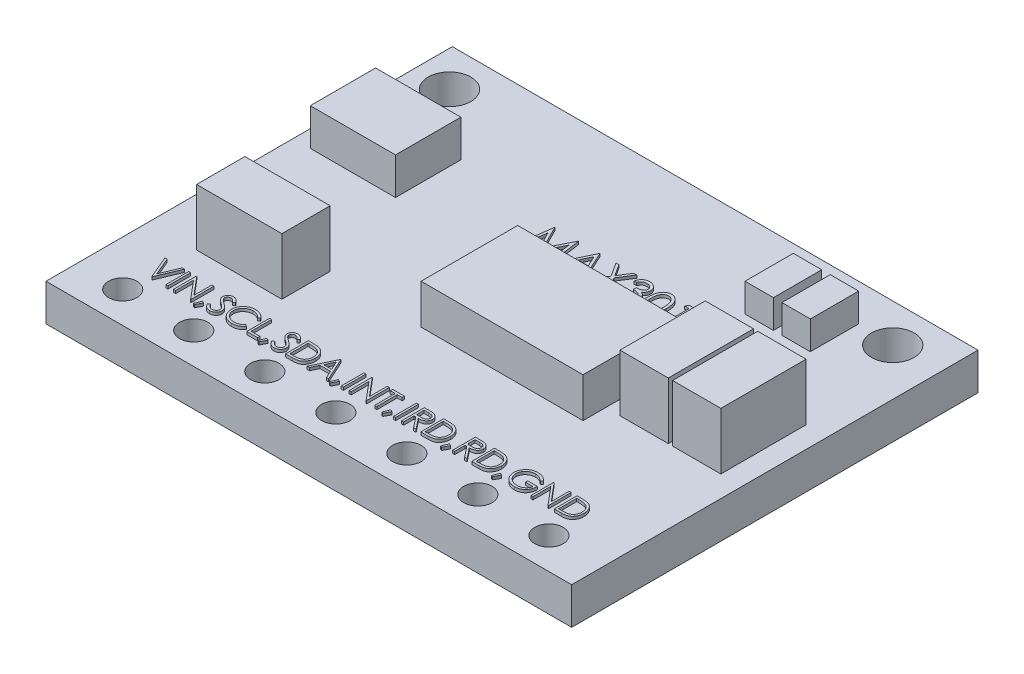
from build123d import *

# Parameters (mm, degrees)
SKETCH1_W         = 18.5
SKETCH1_H         = 14.3
BASE_DEPTH        = 1.3
SKETCH2_R         = 0.5
ELECTRODES1_DEPTH = 24.418582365
ELECTRODESN_COUNT = 7
ELECTRODESN_PITCH = 2.5
SKETCH3_R         = 0.75
FIXINGHOLE_DEPTH  = 24.418582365
SKETCH4_W         = 1.7
SKETCH4_H         = 3
SKETCH4_W_2       = 3
SKETCH4_H_2       = 1.7
COMPONENT1_DEPTH  = 2
SKETCH5_W         = 5.7
SKETCH5_H         = 3.4
SENSOR_DEPTH      = 1.4
SKETCH6_W         = 1
SKETCH6_H         = 1.7
COMPONENT2_DEPTH  = 1
SKETCH7_W         = 3
SKETCH7_H         = 2.3
COMPONENT3_DEPTH  = 1.3
SKETCH8_W         = 0.071794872
SKETCH8_H         = 0.8
TEXT_2_DEPTH      = 0.1


with BuildPart() as part:
    # Sketch1 → base (new body)
    with BuildSketch(Plane(origin=(0, 0, 0), x_dir=(1, 0, 0), z_dir=(0, 1, 0))):
        with Locations((9.25, 7.15)):
            Rectangle(SKETCH1_W, SKETCH1_H)
    extrude(amount=BASE_DEPTH)

    # Sketch2 → electrodes1 (cut, through all)
    with BuildSketch(Plane(origin=(0, 1.3, 0), x_dir=(1, 0, 0), z_dir=(0, 1, 0))):
        with Locations(Location((1.6, 1.1, 0), (0, 0, 270))):
            Circle(SKETCH2_R)
    electrodes1 = extrude(amount=-ELECTRODES1_DEPTH, mode=Mode.SUBTRACT)

    # electrodesN: electrodes1 ×7
    with Locations(*[(i * ELECTRODESN_PITCH, 0, 0) for i in range(1, ELECTRODESN_COUNT)]):
        add(electrodes1, mode=Mode.SUBTRACT)

    # Sketch3 → fixingHole (cut, through all)
    with BuildSketch(Plane(origin=(0, 1.3, 0), x_dir=(1, 0, 0), z_dir=(0, 1, 0))):
        with Locations(Location((1.25, 12.95, 0), (0, 0, 270))):
            Circle(SKETCH3_R)
        with Locations(Location((16.85, 12.95, 0), (0, 0, 270))):
            Circle(SKETCH3_R)
    extrude(amount=-FIXINGHOLE_DEPTH, mode=Mode.SUBTRACT)

    # Sketch4 → component1 (add)
    with BuildSketch(Plane(origin=(0, 1.3, 0), x_dir=(1, 0, 0), z_dir=(0, 1, 0))):
        with Locations((15.05, 7.5)):
            Rectangle(SKETCH4_W, SKETCH4_H)
        with Locations((16.9, 7.5)):
            Rectangle(SKETCH4_W, SKETCH4_H)
        with Locations((3.2, 4.45)):
            Rectangle(SKETCH4_W_2, SKETCH4_H_2)
    extrude(amount=COMPONENT1_DEPTH)

    # Sketch5 → sensor (add)
    with BuildSketch(Plane(origin=(0, 1.3, 0), x_dir=(1, 0, 0), z_dir=(0, 1, 0))):
        with Locations((10.85, 6.9)):
            Rectangle(SKETCH5_W, SKETCH5_H)
    extrude(amount=SENSOR_DEPTH)

    # Sketch6 → component2 (add)
    with BuildSketch(Plane(origin=(0, 1.3, 0), x_dir=(1, 0, 0), z_dir=(0, 1, 0))):
        with Locations((15.1, 12.15)):
            Rectangle(SKETCH6_W, SKETCH6_H)
        with Locations((13.8, 12.15)):
            Rectangle(SKETCH6_W, SKETCH6_H)
    extrude(amount=COMPONENT2_DEPTH)

    # Sketch7 → component3 (add)
    with BuildSketch(Plane(origin=(0, 1.3, 0), x_dir=(1, 0, 0), z_dir=(0, 1, 0))):
        with Locations((2.1, 9.85)):
            Rectangle(SKETCH7_W, SKETCH7_H)
    extrude(amount=COMPONENT3_DEPTH)

    # Sketch8 → text 2 (add)
    # profile 1 of 34: a face of its own
    with BuildSketch(Plane(origin=(0, 1.3, 0), x_dir=(1, 0, 0), z_dir=(0, 1, 0))):
        Polygon((7.2736132, 9.486246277), (7.405624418, 10.486246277), (7.418444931, 10.486246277), (7.831305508, 9.665733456), (8.243164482, 10.486246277), (8.256185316, 10.486246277), (8.388997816, 9.486246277), (8.298853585, 9.486246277), (8.20310038, 10.205797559), (7.842122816, 9.486246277), (7.821890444, 9.486246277), (7.459510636, 10.207400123), (7.363957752, 9.486246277), align=None)
    # profile 2 of 34: a face of its own
    with BuildSketch(Plane(origin=(0, 1.3, 0), x_dir=(1, 0, 0), z_dir=(0, 1, 0))):
        Polygon((9.004382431, 10.486246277), (9.465920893, 9.486246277), (9.368364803, 9.486246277), (9.220528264, 9.806759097), (8.767202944, 9.806759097), (8.615159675, 9.486246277), (8.517202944, 9.486246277), (8.991561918, 10.486246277), align=None)
        Polygon((8.996970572, 10.291334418), (8.815880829, 9.9093232), (9.173252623, 9.9093232), align=None, mode=Mode.SUBTRACT)
    # profile 3 of 34: a face of its own
    with BuildSketch(Plane(origin=(0, 1.3, 0), x_dir=(1, 0, 0), z_dir=(0, 1, 0))):
        Polygon((9.574895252, 10.486246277), (9.678460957, 10.486246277), (9.940279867, 10.07719179), (10.202098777, 10.486246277), (10.305664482, 10.486246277), (9.99216288, 9.996262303), (10.318484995, 9.486246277), (10.21491929, 9.486246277), (9.940279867, 9.915332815), (9.665640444, 9.486246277), (9.562074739, 9.486246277), (9.888597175, 9.996262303), align=None)
    # profile 4 of 34: a face of its own
    with BuildSketch(Plane(origin=(0, 1.3, 0), x_dir=(1, 0, 0), z_dir=(0, 1, 0))):
        with BuildLine():
            Line((10.530023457, 10.255477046), (10.440279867, 10.255477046))
            add(Edge.make_bspline(
                [(10.440279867, 10.255477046), (10.442711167, 10.26554347), (10.44746416, 10.285222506), (10.457377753, 10.313338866), (10.46817754, 10.339945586), (10.481145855, 10.364544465), (10.495291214, 10.387629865), (10.511497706, 10.408678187), (10.529017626, 10.428224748), (10.548396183, 10.445571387), (10.568718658, 10.46127931), (10.590271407, 10.474672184), (10.612620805, 10.48619337), (10.6359217, 10.495684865), (10.660243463, 10.502835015), (10.685366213, 10.508022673), (10.711355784, 10.511391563), (10.728997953, 10.511720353), (10.737956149, 10.511887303)],
                knots=[0, 0, 0, 0, 1.162005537, 2.271625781, 3.343758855, 4.383309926, 5.390229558, 6.379919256, 7.361854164, 8.333198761, 9.295911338, 10.242430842, 11.177959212, 12.116337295, 13.062827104, 14.020064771, 14.994644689, 16, 16, 16, 16], degree=3))
            add(Edge.make_bspline(
                [(10.737956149, 10.511887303), (10.751008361, 10.511493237), (10.776828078, 10.510713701), (10.814760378, 10.503595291), (10.851339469, 10.492330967), (10.886164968, 10.476767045), (10.918513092, 10.45757067), (10.947294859, 10.434723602), (10.972120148, 10.408666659), (10.992947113, 10.379885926), (11.009254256, 10.349127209), (11.021278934, 10.317470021), (11.028599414, 10.284989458), (11.029548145, 10.263058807), (11.030023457, 10.252071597)],
                knots=[0, 0, 0, 0, 1.083050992, 2.142477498, 3.193116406, 4.255571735, 5.30263384, 6.308962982, 7.297363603, 8.282367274, 9.249857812, 10.179914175, 11.08814088, 12, 12, 12, 12], degree=3))
            add(Edge.make_bspline(
                [(11.030023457, 10.252071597), (11.029691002, 10.241498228), (11.02904044, 10.220807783), (11.023516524, 10.190601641), (11.014220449, 10.162132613), (11.001343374, 10.135280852), (10.98467436, 10.110216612), (10.964482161, 10.0868835), (10.940624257, 10.065178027), (10.922544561, 10.052743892), (10.913236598, 10.046342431)],
                knots=[0, 0, 0, 0, 1.024540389, 2.004866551, 2.965041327, 3.920577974, 4.882998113, 5.874504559, 6.905732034, 8, 8, 8, 8], degree=3))
            add(Edge.make_bspline(
                [(10.913236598, 10.046342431), (10.923874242, 10.04120581), (10.944950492, 10.03102868), (10.973679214, 10.011069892), (10.999758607, 9.988025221), (11.014302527, 9.970041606), (11.021609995, 9.961005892)],
                knots=[0, 0, 0, 0, 1.015518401, 2.012035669, 3.001164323, 4, 4, 4, 4], degree=3))
            add(Edge.make_bspline(
                [(11.021609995, 9.961005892), (11.026421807, 9.954417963), (11.035966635, 9.941349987), (11.047748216, 9.92033958), (11.058436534, 9.899096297), (11.066765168, 9.877050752), (11.073214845, 9.854458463), (11.077825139, 9.831280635), (11.08068918, 9.807498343), (11.081099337, 9.791409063), (11.081305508, 9.783321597)],
                knots=[0, 0, 0, 0, 1.025084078, 2.033381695, 3.024893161, 4.013698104, 4.991890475, 5.976764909, 6.982997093, 8, 8, 8, 8], degree=3))
            add(Edge.make_bspline(
                [(11.081305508, 9.783321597), (11.08079279, 9.76931882), (11.079769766, 9.741379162), (11.070625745, 9.70010067), (11.056450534, 9.659750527), (11.03631998, 9.621157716), (11.011786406, 9.585049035), (10.9825986, 9.552741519), (10.949088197, 9.524970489), (10.911715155, 9.501767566), (10.871224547, 9.483219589), (10.827917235, 9.470346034), (10.782417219, 9.461961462), (10.751215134, 9.461062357), (10.735351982, 9.460605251)],
                knots=[0, 0, 0, 0, 0.955779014, 1.907060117, 2.875433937, 3.871313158, 4.872415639, 5.851225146, 6.836215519, 7.83643374, 8.849228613, 9.86973379, 10.916971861, 12, 12, 12, 12], degree=3))
            add(Edge.make_bspline(
                [(10.735351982, 9.460605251), (10.724660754, 9.460853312), (10.703623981, 9.461341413), (10.672697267, 9.464678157), (10.643176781, 9.470772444), (10.615022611, 9.478973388), (10.588209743, 9.489371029), (10.562819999, 9.502319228), (10.538697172, 9.517551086), (10.5160689, 9.535246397), (10.494937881, 9.555041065), (10.475865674, 9.577286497), (10.458534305, 9.601571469), (10.443407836, 9.628178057), (10.429797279, 9.656762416), (10.41860272, 9.687690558), (10.4087497, 9.720685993), (10.40416871, 9.743679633), (10.401818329, 9.755477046)],
                knots=[0, 0, 0, 0, 1.048658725, 2.063410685, 3.046034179, 4.001477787, 4.936774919, 5.862367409, 6.792675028, 7.730719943, 8.675894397, 9.627829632, 10.600096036, 11.597688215, 12.626045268, 13.701542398, 14.82072376, 16, 16, 16, 16], degree=3))
            Line((10.401818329, 9.755477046), (10.491561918, 9.755477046))
            add(Edge.make_bspline(
                [(10.491561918, 9.755477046), (10.493900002, 9.747777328), (10.498447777, 9.732800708), (10.506189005, 9.711246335), (10.515008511, 9.691486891), (10.524469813, 9.673377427), (10.534406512, 9.656739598), (10.545525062, 9.64201335), (10.557001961, 9.628551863), (10.565653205, 9.620967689), (10.569887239, 9.617255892)],
                knots=[0, 0, 0, 0, 1.198163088, 2.33053128, 3.407730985, 4.417276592, 5.372219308, 6.28897303, 7.162600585, 8, 8, 8, 8], degree=3))
            add(Edge.make_bspline(
                [(10.569887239, 9.617255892), (10.575486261, 9.612939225), (10.586667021, 9.604319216), (10.604886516, 9.593318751), (10.624047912, 9.58378703), (10.64456639, 9.576505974), (10.665999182, 9.570340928), (10.688692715, 9.566306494), (10.712446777, 9.563538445), (10.728666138, 9.563294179), (10.736954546, 9.563169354)],
                knots=[0, 0, 0, 0, 0.946170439, 1.889420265, 2.845303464, 3.807233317, 4.801018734, 5.828864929, 6.890507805, 8, 8, 8, 8], degree=3))
            add(Edge.make_bspline(
                [(10.736954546, 9.563169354), (10.74631269, 9.563345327), (10.764611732, 9.563689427), (10.79131312, 9.566853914), (10.816715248, 9.571462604), (10.840536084, 9.578580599), (10.863087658, 9.587375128), (10.884053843, 9.598417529), (10.903709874, 9.611373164), (10.92180399, 9.626098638), (10.938074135, 9.642219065), (10.95239971, 9.659079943), (10.964578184, 9.67661018), (10.974402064, 9.694906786), (10.982159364, 9.713893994), (10.987440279, 9.733625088), (10.99111214, 9.753938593), (10.991411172, 9.76774687), (10.991561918, 9.774707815)],
                knots=[0, 0, 0, 0, 1.217147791, 2.380027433, 3.494444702, 4.572153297, 5.609568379, 6.639424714, 7.649109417, 8.668170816, 9.669597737, 10.625200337, 11.543417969, 12.441394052, 13.322311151, 14.205496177, 15.095365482, 16, 16, 16, 16], degree=3))
            add(Edge.make_bspline(
                [(10.991561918, 9.774707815), (10.991124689, 9.784025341), (10.990252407, 9.802614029), (10.983592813, 9.829961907), (10.972638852, 9.856311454), (10.957303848, 9.881213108), (10.938636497, 9.904291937), (10.916817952, 9.924883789), (10.89166703, 9.941875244), (10.868518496, 9.95361486), (10.848014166, 9.961625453), (10.830466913, 9.966961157), (10.810822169, 9.971479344), (10.789317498, 9.97568285), (10.765790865, 9.979260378), (10.740267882, 9.982243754), (10.712743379, 9.984630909), (10.69368876, 9.985696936), (10.683869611, 9.986246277)],
                knots=[0, 0, 0, 0, 1.07054697, 2.135767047, 3.216561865, 4.33974944, 5.486079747, 6.621378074, 7.775625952, 8.963672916, 9.598146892, 10.304877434, 11.070270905, 11.915000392, 12.823868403, 13.805723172, 14.86925407, 16, 16, 16, 16], degree=3))
            Line((10.683869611, 9.986246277), (10.683869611, 10.088810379))
            add(Edge.make_bspline(
                [(10.683869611, 10.088810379), (10.696241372, 10.089020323), (10.720474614, 10.089431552), (10.755872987, 10.094405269), (10.789722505, 10.101285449), (10.821273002, 10.111824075), (10.850029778, 10.12406416), (10.874978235, 10.138307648), (10.895768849, 10.154140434), (10.912300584, 10.171806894), (10.924737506, 10.19075405), (10.933830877, 10.210501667), (10.939202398, 10.231222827), (10.939919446, 10.24536416), (10.940279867, 10.252472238)],
                knots=[0, 0, 0, 0, 1.321986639, 2.589447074, 3.816329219, 5.01088745, 6.139805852, 7.153945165, 8.075214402, 8.924034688, 9.728124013, 10.488707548, 11.240355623, 12, 12, 12, 12], degree=3))
            add(Edge.make_bspline(
                [(10.940279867, 10.252472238), (10.940161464, 10.257694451), (10.939925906, 10.268083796), (10.936955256, 10.283262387), (10.932491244, 10.297976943), (10.926354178, 10.312164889), (10.918139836, 10.325727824), (10.908309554, 10.338781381), (10.896604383, 10.351251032), (10.883191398, 10.362873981), (10.868788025, 10.373950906), (10.853002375, 10.383354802), (10.836310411, 10.391396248), (10.818693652, 10.398027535), (10.800094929, 10.403015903), (10.780601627, 10.406597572), (10.760176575, 10.408836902), (10.746241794, 10.409159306), (10.739158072, 10.4093232)],
                knots=[0, 0, 0, 0, 0.884392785, 1.759457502, 2.611959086, 3.489218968, 4.37281399, 5.2945488, 6.255912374, 7.266815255, 8.301784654, 9.332968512, 10.37626691, 11.440494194, 12.520033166, 13.637162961, 14.798855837, 16, 16, 16, 16], degree=3))
            add(Edge.make_bspline(
                [(10.739158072, 10.4093232), (10.727771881, 10.408925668), (10.705532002, 10.408149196), (10.673470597, 10.401348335), (10.643665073, 10.390497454), (10.620882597, 10.377545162), (10.604059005, 10.364759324), (10.592037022, 10.353592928), (10.580231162, 10.34118355), (10.569418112, 10.326766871), (10.55848269, 10.311319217), (10.548527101, 10.294055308), (10.538852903, 10.275425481), (10.533023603, 10.2622553), (10.530023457, 10.255477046)],
                knots=[0, 0, 0, 0, 1.472543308, 2.876219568, 4.221790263, 5.565193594, 6.249813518, 6.953379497, 7.687249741, 8.463570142, 9.283606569, 10.136032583, 11.040678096, 12, 12, 12, 12], degree=3))
        make_face()
    # profile 5 of 34: a face of its own
    with BuildSketch(Plane(origin=(0, 1.3, 0), x_dir=(1, 0, 0), z_dir=(0, 1, 0))):
        with BuildLine():
            add(Edge.make_bspline(
                [(11.171049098, 9.985845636), (11.171142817, 10.001873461), (11.171324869, 10.033007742), (11.173350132, 10.078374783), (11.176714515, 10.120934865), (11.181325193, 10.160690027), (11.186936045, 10.197650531), (11.194426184, 10.231717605), (11.202944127, 10.263048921), (11.212816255, 10.291746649), (11.223955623, 10.318197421), (11.236079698, 10.342890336), (11.249669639, 10.365788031), (11.263948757, 10.387255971), (11.279495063, 10.406942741), (11.295866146, 10.425126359), (11.313700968, 10.441386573), (11.332393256, 10.456199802), (11.352112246, 10.469185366), (11.372295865, 10.480623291), (11.393083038, 10.490394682), (11.414530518, 10.498077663), (11.436445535, 10.50442362), (11.458904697, 10.508763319), (11.481945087, 10.511493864), (11.497496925, 10.511754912), (11.505384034, 10.511887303)],
                knots=[0, 0, 0, 0, 1.646270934, 3.197905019, 4.663502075, 6.030701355, 7.308322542, 8.50163776, 9.611534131, 10.641858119, 11.616356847, 12.558055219, 13.465016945, 14.349605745, 15.204443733, 16.039544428, 16.859896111, 17.680448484, 18.487036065, 19.28249412, 20.06191084, 20.843045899, 21.620316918, 22.403196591, 23.190181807, 24, 24, 24, 24], degree=3))
            add(Edge.make_bspline(
                [(11.505384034, 10.511887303), (11.513337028, 10.511747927), (11.52915303, 10.511470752), (11.552535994, 10.508806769), (11.575378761, 10.504386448), (11.597583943, 10.498123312), (11.619333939, 10.490353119), (11.640458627, 10.480613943), (11.661089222, 10.469277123), (11.680897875, 10.455956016), (11.700102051, 10.441103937), (11.718230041, 10.424314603), (11.735283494, 10.40575754), (11.751476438, 10.385631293), (11.766349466, 10.36354984), (11.780513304, 10.339897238), (11.793191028, 10.314259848), (11.805400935, 10.287065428), (11.815940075, 10.257561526), (11.825444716, 10.225914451), (11.833124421, 10.191750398), (11.839521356, 10.155248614), (11.844477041, 10.116275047), (11.848086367, 10.074913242), (11.849992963, 10.031135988), (11.85035202, 10.001205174), (11.850536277, 9.985845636)],
                knots=[0, 0, 0, 0, 0.810914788, 1.612654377, 2.396697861, 3.181598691, 3.963628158, 4.749916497, 5.551656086, 6.361998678, 7.18212741, 8.025565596, 8.878627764, 9.750805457, 10.657531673, 11.591944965, 12.560506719, 13.57287815, 14.630710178, 15.753379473, 16.941251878, 18.199788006, 19.531962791, 20.947069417, 22.433333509, 24, 24, 24, 24], degree=3))
            add(Edge.make_bspline(
                [(11.850536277, 9.985845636), (11.85035011, 9.970553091), (11.849987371, 9.94075619), (11.848107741, 9.897175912), (11.844405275, 9.856033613), (11.83977385, 9.817230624), (11.833359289, 9.780928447), (11.825472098, 9.747001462), (11.816714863, 9.715303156), (11.805904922, 9.68609321), (11.794073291, 9.658964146), (11.781200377, 9.633630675), (11.767408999, 9.609868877), (11.752383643, 9.58786895), (11.736368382, 9.567475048), (11.719020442, 9.549047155), (11.700828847, 9.532141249), (11.681568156, 9.517097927), (11.66145057, 9.50393084), (11.640890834, 9.492155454), (11.619524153, 9.482660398), (11.597834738, 9.474507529), (11.575512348, 9.468278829), (11.552584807, 9.463972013), (11.52916874, 9.460951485), (11.513339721, 9.460721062), (11.505384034, 9.460605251)],
                knots=[0, 0, 0, 0, 1.561518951, 3.042555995, 4.452378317, 5.7783523, 7.031515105, 8.214008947, 9.334062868, 10.386615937, 11.391082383, 12.354592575, 13.286541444, 14.194233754, 15.072674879, 15.931287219, 16.775624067, 17.606195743, 18.42308326, 19.229000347, 20.022332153, 20.807536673, 21.593273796, 22.3848459, 23.188221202, 24, 24, 24, 24], degree=3))
            add(Edge.make_bspline(
                [(11.505384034, 9.460605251), (11.497497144, 9.460738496), (11.481945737, 9.461001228), (11.458902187, 9.463719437), (11.436535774, 9.46808958), (11.41473613, 9.47420861), (11.393391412, 9.481698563), (11.372792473, 9.491456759), (11.352710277, 9.502695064), (11.333198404, 9.515493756), (11.314623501, 9.530157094), (11.296881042, 9.546375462), (11.280416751, 9.56455358), (11.265092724, 9.584404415), (11.250528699, 9.605745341), (11.237131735, 9.628867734), (11.224740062, 9.653679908), (11.213413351, 9.680342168), (11.203370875, 9.709243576), (11.194500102, 9.74071477), (11.187496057, 9.775033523), (11.181500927, 9.8119242), (11.176665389, 9.851545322), (11.173364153, 9.893918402), (11.171323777, 9.939017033), (11.171142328, 9.969951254), (11.171049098, 9.985845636)],
                knots=[0, 0, 0, 0, 0.810891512, 1.598919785, 2.382837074, 3.152667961, 3.926044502, 4.706494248, 5.493654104, 6.291793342, 7.103789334, 7.925228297, 8.761435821, 9.622817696, 10.50288917, 11.416980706, 12.369136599, 13.353924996, 14.394355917, 15.514179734, 16.714354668, 17.994756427, 19.357759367, 20.818452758, 22.365282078, 24, 24, 24, 24], degree=3))
        make_face()
        with BuildLine():
            add(Edge.make_bspline(
                [(11.260792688, 9.986246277), (11.260826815, 9.972889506), (11.26089305, 9.946966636), (11.262623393, 9.909297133), (11.264980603, 9.874162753), (11.268020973, 9.841518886), (11.272536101, 9.811476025), (11.277595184, 9.783827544), (11.283751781, 9.758719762), (11.291036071, 9.735980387), (11.299332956, 9.715223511), (11.308391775, 9.695908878), (11.31812341, 9.677808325), (11.329014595, 9.661084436), (11.340876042, 9.645682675), (11.35343983, 9.631330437), (11.367174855, 9.6185313), (11.386175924, 9.60318077), (11.411260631, 9.58731816), (11.442866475, 9.573504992), (11.475343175, 9.56482429), (11.49738639, 9.56372036), (11.508388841, 9.563169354)],
                knots=[0, 0, 0, 0, 1.459021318, 2.831673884, 4.118529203, 5.306027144, 6.411944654, 7.436330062, 8.375795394, 9.233974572, 10.042671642, 10.816086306, 11.563610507, 12.285937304, 12.993564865, 13.685989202, 14.367179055, 15.041617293, 16.353048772, 17.594441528, 18.799311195, 20, 20, 20, 20], degree=3))
            add(Edge.make_bspline(
                [(11.508388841, 9.563169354), (11.519462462, 9.563625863), (11.54158684, 9.564537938), (11.573910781, 9.573337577), (11.605290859, 9.586614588), (11.629882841, 9.602313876), (11.64859214, 9.617264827), (11.661996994, 9.630011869), (11.674300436, 9.644284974), (11.685969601, 9.659684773), (11.696672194, 9.676505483), (11.706404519, 9.694666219), (11.715285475, 9.714217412), (11.720345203, 9.727865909), (11.722932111, 9.734844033)],
                knots=[0, 0, 0, 0, 1.353760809, 2.704726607, 4.075137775, 5.516104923, 6.260822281, 7.007110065, 7.778089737, 8.566572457, 9.372053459, 10.217411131, 11.088608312, 12, 12, 12, 12], degree=3))
            add(Edge.make_bspline(
                [(11.722932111, 9.734844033), (11.725946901, 9.743766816), (11.73206822, 9.761883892), (11.739957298, 9.789987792), (11.746170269, 9.819474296), (11.751759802, 9.850167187), (11.755574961, 9.882292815), (11.758645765, 9.915751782), (11.760454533, 9.950569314), (11.760678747, 9.974225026), (11.760792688, 9.986246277)],
                knots=[0, 0, 0, 0, 0.884706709, 1.796334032, 2.740027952, 3.714592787, 4.726048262, 5.777819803, 6.87074269, 8, 8, 8, 8], degree=3))
            add(Edge.make_bspline(
                [(11.760792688, 9.986246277), (11.760635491, 9.998265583), (11.76032798, 10.021777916), (11.759152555, 10.056211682), (11.756117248, 10.088916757), (11.752746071, 10.120034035), (11.747775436, 10.149391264), (11.742416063, 10.177234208), (11.735215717, 10.20321793), (11.727524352, 10.227749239), (11.718721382, 10.250549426), (11.709031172, 10.271724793), (11.698682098, 10.291377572), (11.687441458, 10.309453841), (11.675442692, 10.326034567), (11.662369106, 10.340787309), (11.648739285, 10.354169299), (11.629648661, 10.369444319), (11.604656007, 10.385019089), (11.57355725, 10.399352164), (11.541194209, 10.407583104), (11.519316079, 10.408743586), (11.508388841, 10.4093232)],
                knots=[0, 0, 0, 0, 1.31362396, 2.569729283, 3.763502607, 4.902122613, 5.988968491, 7.01645872, 7.998833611, 8.933434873, 9.825090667, 10.667526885, 11.477055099, 12.250526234, 12.991942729, 13.710640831, 14.402115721, 15.076753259, 16.378508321, 17.609869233, 18.806226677, 20, 20, 20, 20], degree=3))
            add(Edge.make_bspline(
                [(11.508388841, 10.4093232), (11.497328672, 10.408742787), (11.475188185, 10.407580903), (11.442488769, 10.39938283), (11.411144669, 10.385093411), (11.386218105, 10.369392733), (11.367114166, 10.35443893), (11.353661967, 10.341471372), (11.341048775, 10.327286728), (11.329429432, 10.311743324), (11.31854678, 10.295038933), (11.308552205, 10.277042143), (11.299547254, 10.257661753), (11.291237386, 10.2369142), (11.283930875, 10.214176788), (11.277904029, 10.189099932), (11.272336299, 10.161539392), (11.268394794, 10.131333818), (11.264890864, 10.098681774), (11.26263905, 10.063459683), (11.260887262, 10.025727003), (11.260824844, 9.999670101), (11.260792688, 9.986246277)],
                knots=[0, 0, 0, 0, 1.207732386, 2.417664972, 3.655092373, 4.956220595, 5.625982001, 6.301752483, 6.994047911, 7.697131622, 8.419323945, 9.170223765, 9.943494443, 10.752040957, 11.610060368, 12.549350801, 13.567764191, 14.679664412, 15.874934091, 17.154273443, 18.533957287, 20, 20, 20, 20], degree=3))
        make_face(mode=Mode.SUBTRACT)
    # profile 6 of 34: a face of its own
    with BuildSketch(Plane(origin=(0, 1.3, 0), x_dir=(1, 0, 0), z_dir=(0, 1, 0))):
        Polygon((12.152819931, 10.486246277), (12.337715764, 10.486246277), (12.337715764, 9.486246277), (12.247972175, 9.486246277), (12.247972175, 10.383682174), (12.094126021, 10.383682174), align=None)
    # profile 7 of 34: a face of its own
    with BuildSketch(Plane(origin=(0, 1.3, 0), x_dir=(1, 0, 0), z_dir=(0, 1, 0))):
        with BuildLine():
            add(Edge.make_bspline(
                [(12.709510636, 9.985845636), (12.709604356, 10.001873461), (12.709786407, 10.033007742), (12.71181167, 10.078374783), (12.715176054, 10.120934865), (12.719786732, 10.160690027), (12.725397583, 10.197650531), (12.732887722, 10.231717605), (12.741405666, 10.263048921), (12.751277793, 10.291746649), (12.762417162, 10.318197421), (12.774541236, 10.342890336), (12.788131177, 10.365788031), (12.802410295, 10.387255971), (12.817956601, 10.406942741), (12.834327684, 10.425126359), (12.852162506, 10.441386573), (12.870854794, 10.456199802), (12.890573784, 10.469185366), (12.910757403, 10.480623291), (12.931544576, 10.490394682), (12.952992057, 10.498077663), (12.974907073, 10.50442362), (12.997366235, 10.508763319), (13.020406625, 10.511493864), (13.035958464, 10.511754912), (13.043845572, 10.511887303)],
                knots=[0, 0, 0, 0, 1.646270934, 3.197905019, 4.663502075, 6.030701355, 7.308322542, 8.50163776, 9.611534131, 10.641858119, 11.616356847, 12.558055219, 13.465016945, 14.349605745, 15.204443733, 16.039544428, 16.859896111, 17.680448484, 18.487036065, 19.28249412, 20.06191084, 20.843045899, 21.620316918, 22.403196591, 23.190181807, 24, 24, 24, 24], degree=3))
            add(Edge.make_bspline(
                [(13.043845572, 10.511887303), (13.051798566, 10.511747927), (13.067614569, 10.511470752), (13.090997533, 10.508806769), (13.113840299, 10.504386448), (13.136045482, 10.498123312), (13.157795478, 10.490353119), (13.178920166, 10.480613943), (13.19955076, 10.469277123), (13.219359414, 10.455956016), (13.23856359, 10.441103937), (13.256691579, 10.424314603), (13.273745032, 10.40575754), (13.289937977, 10.385631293), (13.304811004, 10.36354984), (13.318974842, 10.339897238), (13.331652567, 10.314259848), (13.343862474, 10.287065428), (13.354401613, 10.257561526), (13.363906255, 10.225914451), (13.37158596, 10.191750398), (13.377982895, 10.155248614), (13.382938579, 10.116275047), (13.386547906, 10.074913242), (13.388454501, 10.031135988), (13.388813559, 10.001205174), (13.388997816, 9.985845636)],
                knots=[0, 0, 0, 0, 0.810914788, 1.612654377, 2.396697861, 3.181598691, 3.963628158, 4.749916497, 5.551656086, 6.361998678, 7.18212741, 8.025565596, 8.878627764, 9.750805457, 10.657531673, 11.591944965, 12.560506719, 13.57287815, 14.630710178, 15.753379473, 16.941251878, 18.199788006, 19.531962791, 20.947069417, 22.433333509, 24, 24, 24, 24], degree=3))
            add(Edge.make_bspline(
                [(13.388997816, 9.985845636), (13.388811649, 9.970553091), (13.38844891, 9.94075619), (13.386569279, 9.897175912), (13.382866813, 9.856033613), (13.378235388, 9.817230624), (13.371820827, 9.780928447), (13.363933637, 9.747001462), (13.355176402, 9.715303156), (13.344366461, 9.68609321), (13.332534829, 9.658964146), (13.319661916, 9.633630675), (13.305870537, 9.609868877), (13.290845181, 9.58786895), (13.27482992, 9.567475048), (13.257481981, 9.549047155), (13.239290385, 9.532141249), (13.220029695, 9.517097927), (13.199912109, 9.50393084), (13.179352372, 9.492155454), (13.157985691, 9.482660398), (13.136296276, 9.474507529), (13.113973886, 9.468278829), (13.091046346, 9.463972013), (13.067630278, 9.460951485), (13.05180126, 9.460721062), (13.043845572, 9.460605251)],
                knots=[0, 0, 0, 0, 1.561518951, 3.042555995, 4.452378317, 5.7783523, 7.031515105, 8.214008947, 9.334062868, 10.386615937, 11.391082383, 12.354592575, 13.286541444, 14.194233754, 15.072674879, 15.931287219, 16.775624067, 17.606195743, 18.42308326, 19.229000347, 20.022332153, 20.807536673, 21.593273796, 22.3848459, 23.188221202, 24, 24, 24, 24], degree=3))
            add(Edge.make_bspline(
                [(13.043845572, 9.460605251), (13.035958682, 9.460738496), (13.020407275, 9.461001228), (12.997363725, 9.463719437), (12.974997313, 9.46808958), (12.953197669, 9.47420861), (12.93185295, 9.481698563), (12.911254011, 9.491456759), (12.891171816, 9.502695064), (12.871659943, 9.515493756), (12.853085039, 9.530157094), (12.835342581, 9.546375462), (12.81887829, 9.56455358), (12.803554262, 9.584404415), (12.788990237, 9.605745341), (12.775593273, 9.628867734), (12.763201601, 9.653679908), (12.751874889, 9.680342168), (12.741832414, 9.709243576), (12.73296164, 9.74071477), (12.725957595, 9.775033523), (12.719962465, 9.8119242), (12.715126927, 9.851545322), (12.711825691, 9.893918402), (12.709785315, 9.939017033), (12.709603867, 9.969951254), (12.709510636, 9.985845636)],
                knots=[0, 0, 0, 0, 0.810891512, 1.598919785, 2.382837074, 3.152667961, 3.926044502, 4.706494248, 5.493654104, 6.291793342, 7.103789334, 7.925228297, 8.761435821, 9.622817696, 10.50288917, 11.416980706, 12.369136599, 13.353924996, 14.394355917, 15.514179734, 16.714354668, 17.994756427, 19.357759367, 20.818452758, 22.365282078, 24, 24, 24, 24], degree=3))
        make_face()
        with BuildLine():
            add(Edge.make_bspline(
                [(12.799254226, 9.986246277), (12.799288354, 9.972889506), (12.799354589, 9.946966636), (12.801084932, 9.909297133), (12.803442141, 9.874162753), (12.806482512, 9.841518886), (12.81099764, 9.811476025), (12.816056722, 9.783827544), (12.822213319, 9.758719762), (12.82949761, 9.735980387), (12.837794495, 9.715223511), (12.846853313, 9.695908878), (12.856584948, 9.677808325), (12.867476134, 9.661084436), (12.879337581, 9.645682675), (12.891901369, 9.631330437), (12.905636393, 9.6185313), (12.924637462, 9.60318077), (12.949722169, 9.58731816), (12.981328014, 9.573504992), (13.013804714, 9.56482429), (13.035847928, 9.56372036), (13.04685038, 9.563169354)],
                knots=[0, 0, 0, 0, 1.459021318, 2.831673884, 4.118529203, 5.306027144, 6.411944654, 7.436330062, 8.375795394, 9.233974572, 10.042671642, 10.816086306, 11.563610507, 12.285937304, 12.993564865, 13.685989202, 14.367179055, 15.041617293, 16.353048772, 17.594441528, 18.799311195, 20, 20, 20, 20], degree=3))
            add(Edge.make_bspline(
                [(13.04685038, 9.563169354), (13.057924, 9.563625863), (13.080048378, 9.564537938), (13.11237232, 9.573337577), (13.143752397, 9.586614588), (13.16834438, 9.602313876), (13.187053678, 9.617264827), (13.200458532, 9.630011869), (13.212761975, 9.644284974), (13.224431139, 9.659684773), (13.235133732, 9.676505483), (13.244866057, 9.694666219), (13.253747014, 9.714217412), (13.258806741, 9.727865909), (13.261393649, 9.734844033)],
                knots=[0, 0, 0, 0, 1.353760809, 2.704726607, 4.075137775, 5.516104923, 6.260822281, 7.007110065, 7.778089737, 8.566572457, 9.372053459, 10.217411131, 11.088608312, 12, 12, 12, 12], degree=3))
            add(Edge.make_bspline(
                [(13.261393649, 9.734844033), (13.26440844, 9.743766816), (13.270529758, 9.761883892), (13.278418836, 9.789987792), (13.284631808, 9.819474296), (13.290221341, 9.850167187), (13.2940365, 9.882292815), (13.297107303, 9.915751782), (13.298916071, 9.950569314), (13.299140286, 9.974225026), (13.299254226, 9.986246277)],
                knots=[0, 0, 0, 0, 0.884706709, 1.796334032, 2.740027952, 3.714592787, 4.726048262, 5.777819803, 6.87074269, 8, 8, 8, 8], degree=3))
            add(Edge.make_bspline(
                [(13.299254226, 9.986246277), (13.299097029, 9.998265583), (13.298789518, 10.021777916), (13.297614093, 10.056211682), (13.294578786, 10.088916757), (13.291207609, 10.120034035), (13.286236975, 10.149391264), (13.280877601, 10.177234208), (13.273677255, 10.20321793), (13.265985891, 10.227749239), (13.257182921, 10.250549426), (13.247492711, 10.271724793), (13.237143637, 10.291377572), (13.225902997, 10.309453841), (13.21390423, 10.326034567), (13.200830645, 10.340787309), (13.187200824, 10.354169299), (13.168110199, 10.369444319), (13.143117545, 10.385019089), (13.112018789, 10.399352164), (13.079655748, 10.407583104), (13.057777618, 10.408743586), (13.04685038, 10.4093232)],
                knots=[0, 0, 0, 0, 1.31362396, 2.569729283, 3.763502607, 4.902122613, 5.988968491, 7.01645872, 7.998833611, 8.933434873, 9.825090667, 10.667526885, 11.477055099, 12.250526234, 12.991942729, 13.710640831, 14.402115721, 15.076753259, 16.378508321, 17.609869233, 18.806226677, 20, 20, 20, 20], degree=3))
            add(Edge.make_bspline(
                [(13.04685038, 10.4093232), (13.035790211, 10.408742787), (13.013649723, 10.407580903), (12.980950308, 10.39938283), (12.949606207, 10.385093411), (12.924679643, 10.369392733), (12.905575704, 10.35443893), (12.892123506, 10.341471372), (12.879510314, 10.327286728), (12.867890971, 10.311743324), (12.857008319, 10.295038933), (12.847013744, 10.277042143), (12.838008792, 10.257661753), (12.829698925, 10.2369142), (12.822392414, 10.214176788), (12.816365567, 10.189099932), (12.810797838, 10.161539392), (12.806856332, 10.131333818), (12.803352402, 10.098681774), (12.801100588, 10.063459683), (12.799348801, 10.025727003), (12.799286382, 9.999670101), (12.799254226, 9.986246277)],
                knots=[0, 0, 0, 0, 1.207732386, 2.417664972, 3.655092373, 4.956220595, 5.625982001, 6.301752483, 6.994047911, 7.697131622, 8.419323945, 9.170223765, 9.943494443, 10.752040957, 11.610060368, 12.549350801, 13.567764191, 14.679664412, 15.874934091, 17.154273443, 18.533957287, 20, 20, 20, 20], degree=3))
        make_face(mode=Mode.SUBTRACT)
    # profile 8 of 34: a face of its own
    with BuildSketch(Plane(origin=(0, 1.3, 0), x_dir=(1, 0, 0), z_dir=(0, 1, 0))):
        with BuildLine():
            Line((13.606946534, 10.178553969), (13.517202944, 10.178553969))
            add(Edge.make_bspline(
                [(13.517202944, 10.178553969), (13.517787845, 10.190459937), (13.518936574, 10.213842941), (13.524316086, 10.247935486), (13.532013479, 10.280522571), (13.542896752, 10.311342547), (13.556412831, 10.34066792), (13.57262141, 10.36838221), (13.591819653, 10.394379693), (13.613593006, 10.418419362), (13.637241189, 10.440472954), (13.662757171, 10.459517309), (13.689570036, 10.475608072), (13.717598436, 10.489059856), (13.747158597, 10.499156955), (13.777982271, 10.506648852), (13.810204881, 10.511156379), (13.832159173, 10.511640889), (13.843324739, 10.511887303)],
                knots=[0, 0, 0, 0, 1.10065271, 2.161652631, 3.183658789, 4.190468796, 5.17591951, 6.163126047, 7.15150782, 8.156236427, 9.156009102, 10.134482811, 11.092018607, 12.041330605, 13.001268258, 13.972401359, 14.968799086, 16, 16, 16, 16], degree=3))
            add(Edge.make_bspline(
                [(13.843324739, 10.511887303), (13.854289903, 10.511630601), (13.875836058, 10.511126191), (13.907282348, 10.506794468), (13.937218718, 10.500010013), (13.965586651, 10.490491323), (13.992159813, 10.477695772), (14.017137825, 10.462325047), (14.040818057, 10.444547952), (14.062134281, 10.423618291), (14.081708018, 10.401274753), (14.098594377, 10.377421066), (14.11305528, 10.352784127), (14.125108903, 10.32717607), (14.133982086, 10.300355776), (14.140718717, 10.272713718), (14.144526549, 10.243963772), (14.145110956, 10.224504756), (14.145408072, 10.214611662)],
                knots=[0, 0, 0, 0, 1.111607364, 2.184268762, 3.212621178, 4.221274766, 5.211760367, 6.196651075, 7.1921475, 8.207485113, 9.220403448, 10.201281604, 11.166441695, 12.114753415, 13.065576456, 14.026450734, 14.996634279, 16, 16, 16, 16], degree=3))
            add(Edge.make_bspline(
                [(14.145408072, 10.214611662), (14.144924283, 10.200683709), (14.143965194, 10.173072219), (14.135761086, 10.132496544), (14.122947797, 10.093184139), (14.107519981, 10.061544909), (14.091956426, 10.036049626), (14.077931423, 10.015058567), (14.061512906, 9.992457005), (14.042461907, 9.968320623), (14.021172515, 9.942460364), (13.997451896, 9.914891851), (13.971130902, 9.885899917), (13.952657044, 9.866098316), (13.943084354, 9.855837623)],
                knots=[0, 0, 0, 0, 1.184426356, 2.348067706, 3.509069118, 4.696110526, 5.333549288, 6.050745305, 6.844228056, 7.710549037, 8.667450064, 9.695053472, 10.805634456, 12, 12, 12, 12], degree=3))
            Line((13.943084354, 9.855837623), (13.692884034, 9.588810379))
            Line((13.692884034, 9.588810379), (14.158228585, 9.588810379))
            Line((14.158228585, 9.588810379), (14.158228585, 9.486246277))
            Line((14.158228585, 9.486246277), (13.478741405, 9.486246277))
            Line((13.478741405, 9.486246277), (13.866561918, 9.900108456))
            add(Edge.make_bspline(
                [(13.866561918, 9.900108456), (13.876004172, 9.909965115), (13.894140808, 9.92889774), (13.919792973, 9.956538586), (13.942832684, 9.982181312), (13.963409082, 10.005777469), (13.981075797, 10.027672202), (13.996753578, 10.047156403), (14.009315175, 10.065086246), (14.022948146, 10.085869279), (14.03615214, 10.111244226), (14.047498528, 10.142253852), (14.054417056, 10.174175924), (14.055247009, 10.195747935), (14.055664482, 10.206598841)],
                knots=[0, 0, 0, 0, 1.329631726, 2.553950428, 3.673215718, 4.687767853, 5.603093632, 6.413772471, 7.123043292, 7.734684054, 8.834405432, 9.900288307, 10.943827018, 12, 12, 12, 12], degree=3))
            add(Edge.make_bspline(
                [(14.055664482, 10.206598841), (14.055482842, 10.213422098), (14.055124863, 10.226869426), (14.051965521, 10.246585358), (14.04719109, 10.265603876), (14.040349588, 10.283983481), (14.031319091, 10.301539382), (14.020326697, 10.318292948), (14.007643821, 10.334489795), (13.99297203, 10.349676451), (13.976854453, 10.363585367), (13.959827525, 10.375906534), (13.941813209, 10.386203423), (13.92288746, 10.394644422), (13.90310304, 10.40126596), (13.882421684, 10.405854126), (13.860900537, 10.408734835), (13.846205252, 10.409124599), (13.838717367, 10.4093232)],
                knots=[0, 0, 0, 0, 0.991446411, 1.95395049, 2.89581595, 3.838931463, 4.798493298, 5.75982156, 6.748411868, 7.785213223, 8.824556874, 9.840280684, 10.836137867, 11.835679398, 12.848801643, 13.863922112, 14.911575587, 16, 16, 16, 16], degree=3))
            add(Edge.make_bspline(
                [(13.838717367, 10.4093232), (13.830897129, 10.409118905), (13.815539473, 10.408717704), (13.792991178, 10.405911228), (13.771480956, 10.401069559), (13.750954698, 10.394447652), (13.731377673, 10.386030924), (13.712845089, 10.375547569), (13.695398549, 10.363037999), (13.679005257, 10.348854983), (13.663901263, 10.33306424), (13.650630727, 10.315461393), (13.639035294, 10.296367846), (13.628918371, 10.275835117), (13.620702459, 10.253676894), (13.614424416, 10.229971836), (13.609456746, 10.20482287), (13.607797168, 10.187455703), (13.606946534, 10.178553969)],
                knots=[0, 0, 0, 0, 1.031018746, 2.02475058, 2.990194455, 3.934040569, 4.864654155, 5.795059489, 6.735614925, 7.690564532, 8.649604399, 9.611025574, 10.590972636, 11.591080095, 12.624614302, 13.701020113, 14.821632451, 16, 16, 16, 16], degree=3))
        make_face()
    # profile 9 of 34: a face of its own
    with BuildSketch(Plane(origin=(0, 1.3, 0), x_dir=(1, 0, 0), z_dir=(0, 1, 0))):
        Polygon((1.481980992, 2.703550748), (1.558904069, 2.703550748), (1.825570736, 2.07310203), (2.092237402, 2.703550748), (2.169160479, 2.703550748), (1.830698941, 1.903550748), (1.820442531, 1.903550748), align=None)
    # profile 10 of 34: a face of its own
    with BuildSketch(Plane(origin=(0, 1.3, 0), x_dir=(1, 0, 0), z_dir=(0, 1, 0))):
        with Locations((2.348647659, 2.303550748)):
            Rectangle(SKETCH8_W, SKETCH8_H)
    # profile 11 of 34: a face of its own
    with BuildSketch(Plane(origin=(0, 1.3, 0), x_dir=(1, 0, 0), z_dir=(0, 1, 0))):
        Polygon((2.5896733, 1.903550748), (2.5896733, 2.703550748), (2.604737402, 2.703550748), (3.133263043, 2.073903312), (3.133263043, 2.703550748), (3.205057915, 2.703550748), (3.205057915, 1.903550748), (3.188711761, 1.903550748), (2.661468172, 2.531755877), (2.661468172, 1.903550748), align=None)
    # profile 12 of 34: a face of its own
    with BuildSketch(Plane(origin=(0, 1.3, 0), x_dir=(1, 0, 0), z_dir=(0, 1, 0))):
        Polygon((3.459865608, 2.047140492), (3.533263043, 2.011563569), (3.423006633, 1.800986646), (3.369160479, 1.824384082), align=None)
    # profile 13 of 34: a face of its own
    with BuildSketch(Plane(origin=(0, 1.3, 0), x_dir=(1, 0, 0), z_dir=(0, 1, 0))):
        with BuildLine():
            Line((3.625570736, 2.057877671), (3.693198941, 2.098422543))
            add(Edge.make_bspline(
                [(3.693198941, 2.098422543), (3.699488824, 2.087893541), (3.711539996, 2.067720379), (3.731643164, 2.040461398), (3.752473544, 2.017292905), (3.774185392, 1.998349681), (3.79664618, 1.983435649), (3.820002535, 1.972875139), (3.844175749, 1.966288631), (3.860626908, 1.965488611), (3.868839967, 1.96508921)],
                knots=[0, 0, 0, 0, 1.272034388, 2.437168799, 3.508375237, 4.49857839, 5.41946034, 6.295179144, 7.148887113, 8, 8, 8, 8], degree=3))
            add(Edge.make_bspline(
                [(3.868839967, 1.96508921), (3.875854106, 1.965284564), (3.889759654, 1.965671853), (3.910231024, 1.969393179), (3.930112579, 1.975110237), (3.948994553, 1.983297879), (3.966616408, 1.993203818), (3.982069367, 2.005168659), (3.995428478, 2.018564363), (4.006356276, 2.03350897), (4.014740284, 2.049581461), (4.021184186, 2.066078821), (4.024760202, 2.083260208), (4.025298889, 2.094828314), (4.025570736, 2.100666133)],
                knots=[0, 0, 0, 0, 1.095163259, 2.171163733, 3.241058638, 4.321873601, 5.38011039, 6.391990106, 7.366004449, 8.327778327, 9.272591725, 10.192022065, 11.087607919, 12, 12, 12, 12], degree=3))
            add(Edge.make_bspline(
                [(4.025570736, 2.100666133), (4.025233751, 2.107326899), (4.024548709, 2.120867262), (4.018758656, 2.140844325), (4.009650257, 2.160614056), (4.001247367, 2.172842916), (3.996884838, 2.179191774)],
                knots=[0, 0, 0, 0, 0.938893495, 1.908633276, 2.914225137, 4, 4, 4, 4], degree=3))
            add(Edge.make_bspline(
                [(3.996884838, 2.179191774), (3.993302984, 2.183773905), (3.985783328, 2.193393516), (3.972855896, 2.207712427), (3.957686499, 2.222482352), (3.940794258, 2.238267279), (3.921563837, 2.254333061), (3.900597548, 2.27144581), (3.877360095, 2.288954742), (3.861063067, 2.300697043), (3.852654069, 2.306755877)],
                knots=[0, 0, 0, 0, 0.722233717, 1.516239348, 2.393582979, 3.351407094, 4.387010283, 5.505090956, 6.712668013, 8, 8, 8, 8], degree=3))
            add(Edge.make_bspline(
                [(3.852654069, 2.306755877), (3.844237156, 2.312750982), (3.828144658, 2.324213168), (3.805639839, 2.341224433), (3.785515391, 2.356777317), (3.767860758, 2.371018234), (3.752683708, 2.383949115), (3.739864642, 2.395445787), (3.729730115, 2.405819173), (3.724094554, 2.412548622), (3.721564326, 2.415569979)],
                knots=[0, 0, 0, 0, 1.452282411, 2.77665338, 3.964542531, 5.026858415, 5.96415736, 6.766646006, 7.446254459, 8, 8, 8, 8], degree=3))
            add(Edge.make_bspline(
                [(3.721564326, 2.415569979), (3.718027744, 2.420278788), (3.711072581, 2.429539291), (3.70189178, 2.444013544), (3.694088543, 2.458830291), (3.687971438, 2.474029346), (3.682820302, 2.489397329), (3.679355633, 2.505134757), (3.67718617, 2.521171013), (3.676964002, 2.53196267), (3.676852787, 2.537364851)],
                knots=[0, 0, 0, 0, 1.068054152, 2.10047183, 3.106115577, 4.101338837, 5.06977816, 6.043150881, 7.020423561, 8, 8, 8, 8], degree=3))
            add(Edge.make_bspline(
                [(3.676852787, 2.537364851), (3.677151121, 2.545828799), (3.677741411, 2.562575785), (3.682733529, 2.587039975), (3.690613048, 2.610396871), (3.701651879, 2.632415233), (3.715882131, 2.652521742), (3.732349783, 2.670947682), (3.751963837, 2.686437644), (3.773484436, 2.699971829), (3.797040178, 2.710565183), (3.821723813, 2.718556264), (3.847574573, 2.723084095), (3.865083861, 2.723733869), (3.873968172, 2.724063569)],
                knots=[0, 0, 0, 0, 1.005424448, 1.989358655, 2.955360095, 3.929531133, 4.905563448, 5.876582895, 6.856512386, 7.866279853, 8.892233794, 9.918561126, 10.94386622, 12, 12, 12, 12], degree=3))
            add(Edge.make_bspline(
                [(3.873968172, 2.724063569), (3.883395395, 2.723738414), (3.902143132, 2.723091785), (3.929720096, 2.717469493), (3.956271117, 2.708166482), (3.977629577, 2.697609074), (3.994345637, 2.687064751), (4.00709369, 2.677460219), (4.020011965, 2.666403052), (4.033204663, 2.653863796), (4.046448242, 2.639727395), (4.059939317, 2.624090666), (4.073709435, 2.607049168), (4.082567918, 2.594883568), (4.087109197, 2.588646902)],
                knots=[0, 0, 0, 0, 1.286793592, 2.559021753, 3.825965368, 5.121522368, 5.803751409, 6.523245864, 7.299691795, 8.125521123, 9.008227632, 9.944561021, 10.946284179, 12, 12, 12, 12], degree=3))
            Line((4.087109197, 2.588646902), (4.022205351, 2.539448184))
            add(Edge.make_bspline(
                [(4.022205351, 2.539448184), (4.018286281, 2.544497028), (4.010739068, 2.55421992), (3.999280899, 2.567836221), (3.988481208, 2.580274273), (3.977841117, 2.591077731), (3.967922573, 2.600838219), (3.95829582, 2.609194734), (3.949099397, 2.616229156), (3.93750696, 2.623736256), (3.92294291, 2.631177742), (3.904660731, 2.637474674), (3.885555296, 2.641258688), (3.872542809, 2.641759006), (3.865955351, 2.642012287)],
                knots=[0, 0, 0, 0, 1.181633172, 2.275549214, 3.290209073, 4.226197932, 5.078386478, 5.862611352, 6.581680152, 7.217281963, 8.414376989, 9.595101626, 10.782541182, 12, 12, 12, 12], degree=3))
            add(Edge.make_bspline(
                [(3.865955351, 2.642012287), (3.857691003, 2.641735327), (3.841753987, 2.641201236), (3.819127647, 2.635368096), (3.798763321, 2.626183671), (3.781265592, 2.613311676), (3.76669714, 2.598061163), (3.75615875, 2.580511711), (3.749815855, 2.561132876), (3.749041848, 2.547614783), (3.748647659, 2.540730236)],
                knots=[0, 0, 0, 0, 1.14458467, 2.207223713, 3.21896685, 4.227309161, 5.202851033, 6.127160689, 7.046193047, 8, 8, 8, 8], degree=3))
            add(Edge.make_bspline(
                [(3.748647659, 2.540730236), (3.748737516, 2.536444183), (3.748917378, 2.52786507), (3.751425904, 2.51519046), (3.754648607, 2.502547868), (3.759755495, 2.489994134), (3.76680585, 2.47730971), (3.776064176, 2.46427617), (3.787724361, 2.450778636), (3.79665625, 2.441999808), (3.801372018, 2.437364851)],
                knots=[0, 0, 0, 0, 0.858281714, 1.717966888, 2.583508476, 3.4729293, 4.427298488, 5.488583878, 6.674047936, 8, 8, 8, 8], degree=3))
            add(Edge.make_bspline(
                [(3.801372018, 2.437364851), (3.803123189, 2.435802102), (3.80728357, 2.432089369), (3.814889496, 2.426011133), (3.824933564, 2.418513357), (3.837153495, 2.409236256), (3.851774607, 2.398474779), (3.868798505, 2.386366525), (3.888035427, 2.37251842), (3.901686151, 2.362836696), (3.908904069, 2.357717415)],
                knots=[0, 0, 0, 0, 0.420754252, 0.999615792, 1.744751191, 2.668019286, 3.750313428, 4.999500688, 6.413464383, 8, 8, 8, 8], degree=3))
            add(Edge.make_bspline(
                [(3.908904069, 2.357717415), (3.917586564, 2.35139939), (3.934399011, 2.33916541), (3.958320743, 2.320784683), (3.980010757, 2.30280805), (3.999545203, 2.285350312), (4.017117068, 2.26854389), (4.032531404, 2.252186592), (4.045945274, 2.236395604), (4.060386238, 2.216150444), (4.075142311, 2.191286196), (4.087814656, 2.160822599), (4.095805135, 2.130240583), (4.096850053, 2.109685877), (4.097365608, 2.099544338)],
                knots=[0, 0, 0, 0, 1.163667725, 2.253281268, 3.268753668, 4.215851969, 5.092017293, 5.902905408, 6.650798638, 7.335211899, 8.59617414, 9.77448103, 10.901945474, 12, 12, 12, 12], degree=3))
            add(Edge.make_bspline(
                [(4.097365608, 2.099544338), (4.097215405, 2.09237214), (4.096917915, 2.078167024), (4.093498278, 2.057308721), (4.088488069, 2.037050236), (4.080936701, 2.017641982), (4.071719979, 1.998728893), (4.060024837, 1.980807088), (4.046468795, 1.963479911), (4.03091822, 1.947209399), (4.013902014, 1.932273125), (3.995917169, 1.918986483), (3.976934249, 1.907908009), (3.957056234, 1.898867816), (3.936278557, 1.891797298), (3.914608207, 1.886674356), (3.892009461, 1.883530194), (3.876649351, 1.883203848), (3.868839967, 1.883037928)],
                knots=[0, 0, 0, 0, 0.983748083, 1.948392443, 2.894712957, 3.844097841, 4.80183111, 5.778335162, 6.776009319, 7.81870978, 8.863265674, 9.881300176, 10.883814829, 11.87499822, 12.874611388, 13.892143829, 14.928324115, 16, 16, 16, 16], degree=3))
            add(Edge.make_bspline(
                [(3.868839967, 1.883037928), (3.862797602, 1.883154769), (3.850788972, 1.883386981), (3.833026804, 1.885439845), (3.81562347, 1.888344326), (3.798797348, 1.892955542), (3.782331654, 1.898550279), (3.766298, 1.905439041), (3.750688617, 1.913694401), (3.735416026, 1.923133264), (3.720519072, 1.934117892), (3.706137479, 1.946911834), (3.69179938, 1.961162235), (3.677927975, 1.977256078), (3.664242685, 1.994933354), (3.651013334, 2.014359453), (3.637966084, 2.035428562), (3.629779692, 2.050254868), (3.625570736, 2.057877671)],
                knots=[0, 0, 0, 0, 0.915332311, 1.819136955, 2.706846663, 3.586547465, 4.459518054, 5.340707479, 6.227863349, 7.133153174, 8.059268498, 9.028702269, 10.047606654, 11.120612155, 12.245963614, 13.433783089, 14.680604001, 16, 16, 16, 16], degree=3))
        make_face()
    # profile 14 of 34: a face of its own
    with BuildSketch(Plane(origin=(0, 1.3, 0), x_dir=(1, 0, 0), z_dir=(0, 1, 0))):
        with BuildLine():
            Line((4.99992971, 2.556755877), (4.937109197, 2.508678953))
            add(Edge.make_bspline(
                [(4.937109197, 2.508678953), (4.932627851, 2.514019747), (4.923725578, 2.524629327), (4.909403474, 2.539527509), (4.894477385, 2.553485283), (4.878953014, 2.566569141), (4.86255093, 2.578321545), (4.845668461, 2.58935494), (4.828023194, 2.599244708), (4.803622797, 2.611236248), (4.771703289, 2.623749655), (4.731521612, 2.634241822), (4.689576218, 2.640920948), (4.660959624, 2.64164434), (4.646404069, 2.642012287)],
                knots=[0, 0, 0, 0, 0.757959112, 1.505699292, 2.245454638, 2.979532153, 3.711538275, 4.438200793, 5.171680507, 5.909471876, 7.393775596, 8.890124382, 10.418191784, 12, 12, 12, 12], degree=3))
            add(Edge.make_bspline(
                [(4.646404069, 2.642012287), (4.638385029, 2.641919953), (4.622421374, 2.641736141), (4.598730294, 2.639311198), (4.575481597, 2.635902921), (4.552690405, 2.630845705), (4.530385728, 2.624451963), (4.508421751, 2.616811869), (4.487116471, 2.607359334), (4.466175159, 2.596911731), (4.446111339, 2.585111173), (4.427127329, 2.572239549), (4.409292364, 2.558440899), (4.392592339, 2.543663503), (4.377010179, 2.527973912), (4.362658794, 2.51120492), (4.349587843, 2.493410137), (4.337538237, 2.474824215), (4.326746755, 2.455501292), (4.317711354, 2.435369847), (4.309710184, 2.414774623), (4.303378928, 2.39348293), (4.29836761, 2.371644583), (4.294909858, 2.349200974), (4.292512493, 2.32619899), (4.292329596, 2.31060829), (4.292237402, 2.302749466)],
                knots=[0, 0, 0, 0, 1.054917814, 2.100044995, 3.131103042, 4.146048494, 5.169673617, 6.183595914, 7.203665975, 8.234915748, 9.262203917, 10.264457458, 11.251630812, 12.227803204, 13.197192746, 14.159520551, 15.12972552, 16.100847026, 17.073214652, 18.039054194, 19.002613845, 19.979014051, 20.95965708, 21.949030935, 22.966165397, 24, 24, 24, 24], degree=3))
            add(Edge.make_bspline(
                [(4.292237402, 2.302749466), (4.292525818, 2.290925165), (4.293092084, 2.267709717), (4.298131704, 2.233705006), (4.30579001, 2.201128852), (4.317267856, 2.170184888), (4.331420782, 2.140491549), (4.349304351, 2.112551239), (4.370016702, 2.085941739), (4.393850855, 2.061291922), (4.420000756, 2.038774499), (4.448057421, 2.018945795), (4.477950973, 2.002416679), (4.509351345, 1.988662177), (4.542500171, 1.978089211), (4.577337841, 1.970645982), (4.613788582, 1.965790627), (4.638695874, 1.965325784), (4.651372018, 1.96508921)],
                knots=[0, 0, 0, 0, 1.029171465, 2.020641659, 2.987623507, 3.938342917, 4.889210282, 5.84687017, 6.821220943, 7.821438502, 8.827599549, 9.822697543, 10.807740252, 11.797342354, 12.80366471, 13.83203677, 14.896651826, 16, 16, 16, 16], degree=3))
            add(Edge.make_bspline(
                [(4.651372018, 1.96508921), (4.665338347, 1.965475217), (4.692827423, 1.96623497), (4.733140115, 1.97267137), (4.771731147, 1.983107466), (4.808602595, 1.997712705), (4.843650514, 2.016699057), (4.876929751, 2.039715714), (4.908468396, 2.066981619), (4.92743326, 2.08780062), (4.937109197, 2.098422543)],
                knots=[0, 0, 0, 0, 1.028121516, 2.023589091, 2.998037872, 3.967518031, 4.937445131, 5.927275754, 6.942489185, 8, 8, 8, 8], degree=3))
            Line((4.937109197, 2.098422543), (4.99992971, 2.050826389))
            add(Edge.make_bspline(
                [(4.99992971, 2.050826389), (4.994874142, 2.044303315), (4.984787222, 2.03128841), (4.968453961, 2.012940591), (4.951247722, 1.995682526), (4.933040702, 1.979653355), (4.91404235, 1.964532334), (4.893911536, 1.950749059), (4.8729129, 1.938111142), (4.85111759, 1.926539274), (4.828548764, 1.916272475), (4.805233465, 1.907483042), (4.781272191, 1.899911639), (4.756663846, 1.893682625), (4.731357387, 1.888820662), (4.705444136, 1.885570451), (4.678868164, 1.883343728), (4.660938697, 1.883140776), (4.651852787, 1.883037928)],
                knots=[0, 0, 0, 0, 0.986787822, 1.968848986, 2.935600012, 3.899624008, 4.868462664, 5.837806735, 6.815139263, 7.798259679, 8.787526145, 9.778297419, 10.776456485, 11.791383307, 12.812564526, 13.85620153, 14.913611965, 16, 16, 16, 16], degree=3))
            add(Edge.make_bspline(
                [(4.651852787, 1.883037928), (4.64324852, 1.883097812), (4.626234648, 1.883216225), (4.601114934, 1.885134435), (4.576660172, 1.887751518), (4.552940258, 1.891692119), (4.529825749, 1.896342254), (4.507526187, 1.902575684), (4.485822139, 1.90955835), (4.464800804, 1.917765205), (4.444444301, 1.927026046), (4.424818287, 1.937492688), (4.405931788, 1.949077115), (4.387599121, 1.961523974), (4.370091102, 1.975233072), (4.35325601, 1.990014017), (4.336999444, 2.005816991), (4.326941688, 2.017212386), (4.321884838, 2.022941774)],
                knots=[0, 0, 0, 0, 1.114604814, 2.203992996, 3.262667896, 4.300477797, 5.318619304, 6.316056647, 7.298880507, 8.271930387, 9.238335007, 10.195173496, 11.151986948, 12.108099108, 13.064862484, 14.031167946, 15.010108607, 16, 16, 16, 16], degree=3))
            add(Edge.make_bspline(
                [(4.321884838, 2.022941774), (4.313785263, 2.032894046), (4.297683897, 2.052678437), (4.27708374, 2.084743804), (4.259450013, 2.118222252), (4.24519266, 2.153289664), (4.234046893, 2.189867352), (4.226325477, 2.227973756), (4.221307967, 2.267573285), (4.220734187, 2.294507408), (4.220442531, 2.308198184)],
                knots=[0, 0, 0, 0, 0.994628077, 1.977248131, 2.950237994, 3.925870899, 4.908910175, 5.911660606, 6.938484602, 8, 8, 8, 8], degree=3))
            add(Edge.make_bspline(
                [(4.220442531, 2.308198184), (4.220798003, 2.322588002), (4.221497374, 2.350899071), (4.22743927, 2.392447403), (4.236997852, 2.432253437), (4.250574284, 2.470242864), (4.267786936, 2.5066155), (4.289050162, 2.541093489), (4.314116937, 2.573897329), (4.342790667, 2.604529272), (4.374234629, 2.632538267), (4.407907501, 2.657179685), (4.443743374, 2.677686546), (4.481347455, 2.694828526), (4.521001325, 2.708004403), (4.562620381, 2.717227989), (4.606126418, 2.722969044), (4.635809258, 2.723694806), (4.650891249, 2.724063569)],
                knots=[0, 0, 0, 0, 1.032925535, 2.032216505, 3.007276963, 3.968222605, 4.92396291, 5.891752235, 6.871517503, 7.883894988, 8.900124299, 9.891468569, 10.874487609, 11.85992873, 12.854644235, 13.869047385, 14.917252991, 16, 16, 16, 16], degree=3))
            add(Edge.make_bspline(
                [(4.650891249, 2.724063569), (4.660083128, 2.723953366), (4.678277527, 2.72373523), (4.705192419, 2.721608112), (4.73139638, 2.718062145), (4.756907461, 2.713235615), (4.781849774, 2.70724537), (4.806032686, 2.699441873), (4.8295981, 2.690519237), (4.852397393, 2.680243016), (4.874321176, 2.668707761), (4.89536262, 2.656041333), (4.915354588, 2.642259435), (4.934437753, 2.62747928), (4.952292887, 2.611388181), (4.96942694, 2.59442873), (4.985258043, 2.576112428), (4.995030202, 2.563219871), (4.99992971, 2.556755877)],
                knots=[0, 0, 0, 0, 1.096760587, 2.17092713, 3.219439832, 4.250915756, 5.268269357, 6.278326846, 7.281116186, 8.274029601, 9.260640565, 10.235837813, 11.203064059, 12.156899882, 13.114053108, 14.069676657, 15.032185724, 16, 16, 16, 16], degree=3))
        make_face()
    # profile 15 of 34: a face of its own
    with BuildSketch(Plane(origin=(0, 1.3, 0), x_dir=(1, 0, 0), z_dir=(0, 1, 0))):
        Polygon((5.164032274, 2.703550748), (5.235827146, 2.703550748), (5.235827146, 1.98560203), (5.543519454, 1.98560203), (5.543519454, 1.903550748), (5.164032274, 1.903550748), align=None)
    # profile 16 of 34: a face of its own
    with BuildSketch(Plane(origin=(0, 1.3, 0), x_dir=(1, 0, 0), z_dir=(0, 1, 0))):
        Polygon((5.726532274, 2.047140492), (5.79992971, 2.011563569), (5.6896733, 1.800986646), (5.635827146, 1.824384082), align=None)
    # profile 17 of 34: a face of its own
    with BuildSketch(Plane(origin=(0, 1.3, 0), x_dir=(1, 0, 0), z_dir=(0, 1, 0))):
        with BuildLine():
            Line((5.892237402, 2.057877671), (5.959865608, 2.098422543))
            add(Edge.make_bspline(
                [(5.959865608, 2.098422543), (5.96615549, 2.087893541), (5.978206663, 2.067720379), (5.998309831, 2.040461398), (6.019140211, 2.017292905), (6.040852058, 1.998349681), (6.063312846, 1.983435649), (6.086669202, 1.972875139), (6.110842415, 1.966288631), (6.127293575, 1.965488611), (6.135506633, 1.96508921)],
                knots=[0, 0, 0, 0, 1.272034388, 2.437168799, 3.508375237, 4.49857839, 5.41946034, 6.295179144, 7.148887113, 8, 8, 8, 8], degree=3))
            add(Edge.make_bspline(
                [(6.135506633, 1.96508921), (6.142520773, 1.965284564), (6.156426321, 1.965671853), (6.176897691, 1.969393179), (6.196779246, 1.975110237), (6.21566122, 1.983297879), (6.233283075, 1.993203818), (6.248736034, 2.005168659), (6.262095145, 2.018564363), (6.273022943, 2.03350897), (6.281406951, 2.049581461), (6.287850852, 2.066078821), (6.291426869, 2.083260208), (6.291965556, 2.094828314), (6.292237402, 2.100666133)],
                knots=[0, 0, 0, 0, 1.095163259, 2.171163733, 3.241058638, 4.321873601, 5.38011039, 6.391990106, 7.366004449, 8.327778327, 9.272591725, 10.192022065, 11.087607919, 12, 12, 12, 12], degree=3))
            add(Edge.make_bspline(
                [(6.292237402, 2.100666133), (6.291900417, 2.107326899), (6.291215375, 2.120867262), (6.285425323, 2.140844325), (6.276316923, 2.160614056), (6.267914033, 2.172842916), (6.263551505, 2.179191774)],
                knots=[0, 0, 0, 0, 0.938893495, 1.908633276, 2.914225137, 4, 4, 4, 4], degree=3))
            add(Edge.make_bspline(
                [(6.263551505, 2.179191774), (6.25996965, 2.183773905), (6.252449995, 2.193393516), (6.239522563, 2.207712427), (6.224353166, 2.222482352), (6.207460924, 2.238267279), (6.188230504, 2.254333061), (6.167264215, 2.27144581), (6.144026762, 2.288954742), (6.127729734, 2.300697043), (6.119320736, 2.306755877)],
                knots=[0, 0, 0, 0, 0.722233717, 1.516239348, 2.393582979, 3.351407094, 4.387010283, 5.505090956, 6.712668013, 8, 8, 8, 8], degree=3))
            add(Edge.make_bspline(
                [(6.119320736, 2.306755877), (6.110903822, 2.312750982), (6.094811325, 2.324213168), (6.072306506, 2.341224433), (6.052182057, 2.356777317), (6.034527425, 2.371018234), (6.019350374, 2.383949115), (6.006531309, 2.395445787), (5.996396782, 2.405819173), (5.99076122, 2.412548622), (5.988230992, 2.415569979)],
                knots=[0, 0, 0, 0, 1.452282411, 2.77665338, 3.964542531, 5.026858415, 5.96415736, 6.766646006, 7.446254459, 8, 8, 8, 8], degree=3))
            add(Edge.make_bspline(
                [(5.988230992, 2.415569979), (5.98469441, 2.420278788), (5.977739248, 2.429539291), (5.968558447, 2.444013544), (5.960755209, 2.458830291), (5.954638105, 2.474029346), (5.949486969, 2.489397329), (5.946022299, 2.505134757), (5.943852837, 2.521171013), (5.943630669, 2.53196267), (5.943519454, 2.537364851)],
                knots=[0, 0, 0, 0, 1.068054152, 2.10047183, 3.106115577, 4.101338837, 5.06977816, 6.043150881, 7.020423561, 8, 8, 8, 8], degree=3))
            add(Edge.make_bspline(
                [(5.943519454, 2.537364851), (5.943817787, 2.545828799), (5.944408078, 2.562575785), (5.949400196, 2.587039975), (5.957279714, 2.610396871), (5.968318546, 2.632415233), (5.982548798, 2.652521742), (5.999016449, 2.670947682), (6.018630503, 2.686437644), (6.040151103, 2.699971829), (6.063706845, 2.710565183), (6.08839048, 2.718556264), (6.114241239, 2.723084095), (6.131750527, 2.723733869), (6.140634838, 2.724063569)],
                knots=[0, 0, 0, 0, 1.005424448, 1.989358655, 2.955360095, 3.929531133, 4.905563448, 5.876582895, 6.856512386, 7.866279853, 8.892233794, 9.918561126, 10.94386622, 12, 12, 12, 12], degree=3))
            add(Edge.make_bspline(
                [(6.140634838, 2.724063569), (6.150062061, 2.723738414), (6.168809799, 2.723091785), (6.196386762, 2.717469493), (6.222937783, 2.708166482), (6.244296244, 2.697609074), (6.261012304, 2.687064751), (6.273760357, 2.677460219), (6.286678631, 2.666403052), (6.299871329, 2.653863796), (6.313114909, 2.639727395), (6.326605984, 2.624090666), (6.340376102, 2.607049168), (6.349234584, 2.594883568), (6.353775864, 2.588646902)],
                knots=[0, 0, 0, 0, 1.286793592, 2.559021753, 3.825965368, 5.121522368, 5.803751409, 6.523245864, 7.299691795, 8.125521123, 9.008227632, 9.944561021, 10.946284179, 12, 12, 12, 12], degree=3))
            Line((6.353775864, 2.588646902), (6.288872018, 2.539448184))
            add(Edge.make_bspline(
                [(6.288872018, 2.539448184), (6.284952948, 2.544497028), (6.277405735, 2.55421992), (6.265947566, 2.567836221), (6.255147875, 2.580274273), (6.244507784, 2.591077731), (6.234589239, 2.600838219), (6.224962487, 2.609194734), (6.215766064, 2.616229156), (6.204173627, 2.623736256), (6.189609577, 2.631177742), (6.171327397, 2.637474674), (6.152221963, 2.641258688), (6.139209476, 2.641759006), (6.132622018, 2.642012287)],
                knots=[0, 0, 0, 0, 1.181633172, 2.275549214, 3.290209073, 4.226197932, 5.078386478, 5.862611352, 6.581680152, 7.217281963, 8.414376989, 9.595101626, 10.782541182, 12, 12, 12, 12], degree=3))
            add(Edge.make_bspline(
                [(6.132622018, 2.642012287), (6.12435767, 2.641735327), (6.108420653, 2.641201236), (6.085794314, 2.635368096), (6.065429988, 2.626183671), (6.047932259, 2.613311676), (6.033363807, 2.598061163), (6.022825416, 2.580511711), (6.016482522, 2.561132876), (6.015708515, 2.547614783), (6.015314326, 2.540730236)],
                knots=[0, 0, 0, 0, 1.14458467, 2.207223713, 3.21896685, 4.227309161, 5.202851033, 6.127160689, 7.046193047, 8, 8, 8, 8], degree=3))
            add(Edge.make_bspline(
                [(6.015314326, 2.540730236), (6.015404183, 2.536444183), (6.015584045, 2.52786507), (6.01809257, 2.51519046), (6.021315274, 2.502547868), (6.026422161, 2.489994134), (6.033472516, 2.47730971), (6.042730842, 2.46427617), (6.054391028, 2.450778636), (6.063322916, 2.441999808), (6.068038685, 2.437364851)],
                knots=[0, 0, 0, 0, 0.858281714, 1.717966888, 2.583508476, 3.4729293, 4.427298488, 5.488583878, 6.674047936, 8, 8, 8, 8], degree=3))
            add(Edge.make_bspline(
                [(6.068038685, 2.437364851), (6.069789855, 2.435802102), (6.073950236, 2.432089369), (6.081556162, 2.426011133), (6.09160023, 2.418513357), (6.103820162, 2.409236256), (6.118441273, 2.398474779), (6.135465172, 2.386366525), (6.154702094, 2.37251842), (6.168352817, 2.362836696), (6.175570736, 2.357717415)],
                knots=[0, 0, 0, 0, 0.420754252, 0.999615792, 1.744751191, 2.668019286, 3.750313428, 4.999500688, 6.413464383, 8, 8, 8, 8], degree=3))
            add(Edge.make_bspline(
                [(6.175570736, 2.357717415), (6.18425323, 2.35139939), (6.201065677, 2.33916541), (6.22498741, 2.320784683), (6.246677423, 2.30280805), (6.26621187, 2.285350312), (6.283783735, 2.26854389), (6.299198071, 2.252186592), (6.312611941, 2.236395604), (6.327052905, 2.216150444), (6.341808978, 2.191286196), (6.354481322, 2.160822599), (6.362471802, 2.130240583), (6.36351672, 2.109685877), (6.364032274, 2.099544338)],
                knots=[0, 0, 0, 0, 1.163667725, 2.253281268, 3.268753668, 4.215851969, 5.092017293, 5.902905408, 6.650798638, 7.335211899, 8.59617414, 9.77448103, 10.901945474, 12, 12, 12, 12], degree=3))
            add(Edge.make_bspline(
                [(6.364032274, 2.099544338), (6.363882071, 2.09237214), (6.363584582, 2.078167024), (6.360164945, 2.057308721), (6.355154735, 2.037050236), (6.347603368, 2.017641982), (6.338386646, 1.998728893), (6.326691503, 1.980807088), (6.313135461, 1.963479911), (6.297584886, 1.947209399), (6.28056868, 1.932273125), (6.262583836, 1.918986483), (6.243600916, 1.907908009), (6.223722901, 1.898867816), (6.202945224, 1.891797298), (6.181274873, 1.886674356), (6.158676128, 1.883530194), (6.143316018, 1.883203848), (6.135506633, 1.883037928)],
                knots=[0, 0, 0, 0, 0.983748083, 1.948392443, 2.894712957, 3.844097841, 4.80183111, 5.778335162, 6.776009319, 7.81870978, 8.863265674, 9.881300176, 10.883814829, 11.87499822, 12.874611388, 13.892143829, 14.928324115, 16, 16, 16, 16], degree=3))
            add(Edge.make_bspline(
                [(6.135506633, 1.883037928), (6.129464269, 1.883154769), (6.117455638, 1.883386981), (6.099693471, 1.885439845), (6.082290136, 1.888344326), (6.065464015, 1.892955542), (6.048998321, 1.898550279), (6.032964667, 1.905439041), (6.017355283, 1.913694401), (6.002082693, 1.923133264), (5.987185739, 1.934117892), (5.972804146, 1.946911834), (5.958466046, 1.961162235), (5.944594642, 1.977256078), (5.930909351, 1.994933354), (5.917680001, 2.014359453), (5.904632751, 2.035428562), (5.896446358, 2.050254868), (5.892237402, 2.057877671)],
                knots=[0, 0, 0, 0, 0.915332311, 1.819136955, 2.706846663, 3.586547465, 4.459518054, 5.340707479, 6.227863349, 7.133153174, 8.059268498, 9.028702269, 10.047606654, 11.120612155, 12.245963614, 13.433783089, 14.680604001, 16, 16, 16, 16], degree=3))
        make_face()
    # profile 18 of 34: a face of its own
    with BuildSketch(Plane(origin=(0, 1.3, 0), x_dir=(1, 0, 0), z_dir=(0, 1, 0))):
        with BuildLine():
            Line((6.528134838, 1.903550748), (6.528134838, 2.703550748))
            Line((6.528134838, 2.703550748), (6.6896733, 2.703550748))
            add(Edge.make_bspline(
                [(6.6896733, 2.703550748), (6.703723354, 2.70344959), (6.730867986, 2.703254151), (6.770093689, 2.702014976), (6.80638712, 2.69982287), (6.839628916, 2.696629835), (6.869910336, 2.692709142), (6.89714659, 2.687794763), (6.921478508, 2.681991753), (6.936442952, 2.677044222), (6.943519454, 2.674704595)],
                knots=[0, 0, 0, 0, 1.314313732, 2.53924729, 3.670748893, 4.714932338, 5.66265055, 6.526160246, 7.303039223, 8, 8, 8, 8], degree=3))
            add(Edge.make_bspline(
                [(6.943519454, 2.674704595), (6.952775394, 2.671177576), (6.971077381, 2.66420352), (6.997136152, 2.651047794), (7.021667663, 2.636141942), (7.044803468, 2.619466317), (7.066015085, 2.600548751), (7.086131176, 2.580192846), (7.104328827, 2.557658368), (7.120993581, 2.533412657), (7.136018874, 2.507741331), (7.149079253, 2.480693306), (7.15992588, 2.452405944), (7.168930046, 2.42295791), (7.176026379, 2.392284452), (7.180867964, 2.360349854), (7.184061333, 2.327280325), (7.184382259, 2.304840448), (7.184545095, 2.293454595)],
                knots=[0, 0, 0, 0, 0.984719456, 1.947108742, 2.898477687, 3.838006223, 4.779231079, 5.722358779, 6.681677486, 7.655904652, 8.64651281, 9.637519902, 10.640069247, 11.656948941, 12.698408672, 13.768548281, 14.867775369, 16, 16, 16, 16], degree=3))
            add(Edge.make_bspline(
                [(7.184545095, 2.293454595), (7.184401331, 2.283566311), (7.184118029, 2.264080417), (7.181574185, 2.235362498), (7.177876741, 2.207496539), (7.172152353, 2.180615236), (7.165203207, 2.154483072), (7.156297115, 2.129378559), (7.146094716, 2.105071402), (7.134197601, 2.081890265), (7.121136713, 2.059928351), (7.107120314, 2.039225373), (7.092163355, 2.020076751), (7.076123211, 2.002424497), (7.059207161, 1.986295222), (7.041304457, 1.97155419), (7.022368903, 1.958489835), (7.002485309, 1.946588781), (6.981073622, 1.936206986), (6.957728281, 1.927422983), (6.932349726, 1.920143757), (6.90500025, 1.914070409), (6.875632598, 1.90925274), (6.844217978, 1.906023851), (6.810804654, 1.903840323), (6.787860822, 1.903649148), (6.776051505, 1.903550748)],
                knots=[0, 0, 0, 0, 1.105936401, 2.179363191, 3.223086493, 4.248585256, 5.251745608, 6.245858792, 7.225916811, 8.198733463, 9.158002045, 10.082870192, 10.993790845, 11.873723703, 12.748670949, 13.606408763, 14.465103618, 15.319838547, 16.196477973, 17.123216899, 18.106603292, 19.147568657, 20.255746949, 21.433717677, 22.679120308, 24, 24, 24, 24], degree=3))
            Line((6.776051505, 1.903550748), (6.528134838, 1.903550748))
        make_face()
        with BuildLine():
            Line((6.59992971, 1.98560203), (6.691756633, 1.98560203))
            add(Edge.make_bspline(
                [(6.691756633, 1.98560203), (6.704951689, 1.985658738), (6.730330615, 1.985767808), (6.766823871, 1.986724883), (6.800167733, 1.988288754), (6.830366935, 1.990477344), (6.857404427, 1.993373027), (6.881336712, 1.996601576), (6.902085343, 2.000623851), (6.914640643, 2.004269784), (6.920442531, 2.005954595)],
                knots=[0, 0, 0, 0, 1.375205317, 2.645023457, 3.804390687, 4.853969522, 5.800190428, 6.637939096, 7.370582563, 8, 8, 8, 8], degree=3))
            add(Edge.make_bspline(
                [(6.920442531, 2.005954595), (6.927745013, 2.008526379), (6.942175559, 2.013608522), (6.962948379, 2.022878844), (6.982321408, 2.033859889), (7.000632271, 2.046066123), (7.017621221, 2.059928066), (7.033489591, 2.075144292), (7.048205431, 2.091792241), (7.061616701, 2.109851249), (7.073618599, 2.129208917), (7.084012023, 2.149674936), (7.093120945, 2.171025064), (7.100270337, 2.193587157), (7.105873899, 2.217159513), (7.109842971, 2.241743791), (7.112314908, 2.267335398), (7.112603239, 2.284741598), (7.112750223, 2.293614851)],
                knots=[0, 0, 0, 0, 0.998632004, 1.973411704, 2.929992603, 3.868527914, 4.809262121, 5.754881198, 6.702106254, 7.672490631, 8.653608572, 9.636854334, 10.631411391, 11.644891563, 12.686317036, 13.754757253, 14.855430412, 16, 16, 16, 16], degree=3))
            add(Edge.make_bspline(
                [(7.112750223, 2.293614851), (7.1126329, 2.302971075), (7.112402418, 2.32135146), (7.109505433, 2.348320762), (7.105271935, 2.374259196), (7.099149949, 2.399168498), (7.091348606, 2.423097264), (7.081612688, 2.445913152), (7.070488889, 2.467857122), (7.05725384, 2.488422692), (7.042758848, 2.507872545), (7.026672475, 2.525690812), (7.009250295, 2.54191808), (6.990682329, 2.556807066), (6.970445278, 2.569758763), (6.949015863, 2.58134429), (6.92607971, 2.591176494), (6.910122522, 2.596405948), (6.902013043, 2.599063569)],
                knots=[0, 0, 0, 0, 1.122418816, 2.205001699, 3.251619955, 4.274784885, 5.280384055, 6.268708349, 7.249350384, 8.229342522, 9.199999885, 10.157847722, 11.105861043, 12.055065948, 13.010012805, 13.98527497, 14.976112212, 16, 16, 16, 16], degree=3))
            add(Edge.make_bspline(
                [(6.902013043, 2.599063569), (6.89530421, 2.600918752), (6.881039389, 2.604863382), (6.857761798, 2.609166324), (6.831564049, 2.612961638), (6.802329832, 2.616174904), (6.77009247, 2.618480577), (6.73482717, 2.620211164), (6.696518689, 2.621378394), (6.669962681, 2.621458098), (6.65617971, 2.621499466)],
                knots=[0, 0, 0, 0, 0.674548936, 1.434276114, 2.292660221, 3.240891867, 4.284742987, 5.42552168, 6.663806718, 8, 8, 8, 8], degree=3))
            Line((6.65617971, 2.621499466), (6.59992971, 2.621499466))
            Line((6.59992971, 2.621499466), (6.59992971, 1.98560203))
        make_face(mode=Mode.SUBTRACT)
    # profile 19 of 34: a face of its own
    with BuildSketch(Plane(origin=(0, 1.3, 0), x_dir=(1, 0, 0), z_dir=(0, 1, 0))):
        Polygon((7.676852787, 2.703550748), (8.046083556, 1.903550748), (7.968038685, 1.903550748), (7.849769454, 2.159961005), (7.487109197, 2.159961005), (7.365474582, 1.903550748), (7.287109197, 1.903550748), (7.666596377, 2.703550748), align=None)
        Polygon((7.6709233, 2.547621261), (7.526051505, 2.242012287), (7.811948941, 2.242012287), align=None, mode=Mode.SUBTRACT)
    # profile 20 of 34: a face of its own
    with BuildSketch(Plane(origin=(0, 1.3, 0), x_dir=(1, 0, 0), z_dir=(0, 1, 0))):
        Polygon((8.239352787, 2.047140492), (8.312750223, 2.011563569), (8.202493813, 1.800986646), (8.148647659, 1.824384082), align=None)
    # profile 21 of 34: a face of its own
    with BuildSketch(Plane(origin=(0, 1.3, 0), x_dir=(1, 0, 0), z_dir=(0, 1, 0))):
        with Locations((8.523006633, 2.303550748)):
            Rectangle(SKETCH8_W, SKETCH8_H)
    # profile 22 of 34: a face of its own
    with BuildSketch(Plane(origin=(0, 1.3, 0), x_dir=(1, 0, 0), z_dir=(0, 1, 0))):
        Polygon((8.764032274, 1.903550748), (8.764032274, 2.703550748), (8.779096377, 2.703550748), (9.307622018, 2.073903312), (9.307622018, 2.703550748), (9.37941689, 2.703550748), (9.37941689, 1.903550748), (9.363070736, 1.903550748), (8.835827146, 2.531755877), (8.835827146, 1.903550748), align=None)
    # profile 23 of 34: a face of its own
    with BuildSketch(Plane(origin=(0, 1.3, 0), x_dir=(1, 0, 0), z_dir=(0, 1, 0))):
        Polygon((9.492237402, 2.621499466), (9.492237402, 2.703550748), (9.912750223, 2.703550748), (9.912750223, 2.621499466), (9.738391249, 2.621499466), (9.738391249, 1.903550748), (9.666596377, 1.903550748), (9.666596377, 2.621499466), align=None)
    # profile 24 of 34: a face of its own
    with BuildSketch(Plane(origin=(0, 1.3, 0), x_dir=(1, 0, 0), z_dir=(0, 1, 0))):
        Polygon((10.085506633, 2.047140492), (10.158904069, 2.011563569), (10.048647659, 1.800986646), (9.994801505, 1.824384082), align=None)
    # profile 25 of 34: a face of its own
    with BuildSketch(Plane(origin=(0, 1.3, 0), x_dir=(1, 0, 0), z_dir=(0, 1, 0))):
        with Locations((10.369160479, 2.303550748)):
            Rectangle(SKETCH8_W, SKETCH8_H)
    # profile 26 of 34: a face of its own
    with BuildSketch(Plane(origin=(0, 1.3, 0), x_dir=(1, 0, 0), z_dir=(0, 1, 0))):
        with BuildLine():
            Line((10.61018612, 2.703550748), (10.770282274, 2.703550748))
            add(Edge.make_bspline(
                [(10.770282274, 2.703550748), (10.780965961, 2.703515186), (10.801479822, 2.703446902), (10.830867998, 2.703066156), (10.857571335, 2.701974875), (10.88157587, 2.70103577), (10.902881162, 2.699323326), (10.921552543, 2.697686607), (10.937504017, 2.695544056), (10.947160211, 2.693554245), (10.951532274, 2.692653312)],
                knots=[0, 0, 0, 0, 1.410062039, 2.707475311, 3.878576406, 4.937260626, 5.877586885, 6.699081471, 7.410979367, 8, 8, 8, 8], degree=3))
            add(Edge.make_bspline(
                [(10.951532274, 2.692653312), (10.957385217, 2.691207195), (10.968966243, 2.688345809), (10.985640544, 2.6822979), (11.001529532, 2.675299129), (11.016567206, 2.66707885), (11.030678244, 2.657576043), (11.044008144, 2.646954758), (11.056617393, 2.635273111), (11.067996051, 2.622236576), (11.078724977, 2.608559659), (11.087773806, 2.593770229), (11.095574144, 2.578304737), (11.101784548, 2.562005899), (11.106785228, 2.545031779), (11.110311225, 2.527228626), (11.112425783, 2.508677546), (11.112641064, 2.496024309), (11.112750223, 2.489608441)],
                knots=[0, 0, 0, 0, 1.027469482, 2.033020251, 3.019912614, 3.986113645, 4.951240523, 5.91722682, 6.890402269, 7.87763091, 8.8651537, 9.85103654, 10.82876324, 11.815024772, 12.821070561, 13.842952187, 14.906261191, 16, 16, 16, 16], degree=3))
            add(Edge.make_bspline(
                [(11.112750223, 2.489608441), (11.112414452, 2.478948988), (11.111759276, 2.458149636), (11.105650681, 2.427964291), (11.095644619, 2.399806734), (11.081856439, 2.373712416), (11.064297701, 2.350189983), (11.043194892, 2.329529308), (11.018536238, 2.312240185), (10.995580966, 2.300250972), (10.975303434, 2.292572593), (10.958610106, 2.287169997), (10.940400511, 2.282995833), (10.92084912, 2.279256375), (10.89987457, 2.27643313), (10.877527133, 2.274365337), (10.853790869, 2.273072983), (10.837484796, 2.272880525), (10.829096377, 2.272781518)],
                knots=[0, 0, 0, 0, 1.260483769, 2.459530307, 3.627416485, 4.787058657, 5.939039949, 7.08810263, 8.267026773, 9.491475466, 10.141966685, 10.831826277, 11.566392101, 12.351337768, 13.187381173, 14.07005841, 15.007169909, 16, 16, 16, 16], degree=3))
            Line((10.829096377, 2.272781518), (11.123006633, 1.903550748))
            Line((11.123006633, 1.903550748), (11.034224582, 1.903550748))
            Line((11.034224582, 1.903550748), (10.740314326, 2.272781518))
            Line((10.740314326, 2.272781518), (10.681980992, 2.272781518))
            Line((10.681980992, 2.272781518), (10.681980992, 1.903550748))
            Line((10.681980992, 1.903550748), (10.61018612, 1.903550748))
            Line((10.61018612, 1.903550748), (10.61018612, 2.703550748))
        make_face()
        with BuildLine():
            Line((10.681980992, 2.621499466), (10.681980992, 2.3548328))
            Line((10.681980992, 2.3548328), (10.828455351, 2.353711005))
            add(Edge.make_bspline(
                [(10.828455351, 2.353711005), (10.835294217, 2.353707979), (10.848549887, 2.353702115), (10.867727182, 2.354614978), (10.885583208, 2.355653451), (10.902049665, 2.357241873), (10.917133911, 2.359288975), (10.930828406, 2.361849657), (10.943155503, 2.364832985), (10.957532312, 2.3694505), (10.973586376, 2.376766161), (10.991033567, 2.387409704), (11.005891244, 2.400796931), (11.018443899, 2.41610515), (11.028530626, 2.432936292), (11.035641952, 2.451088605), (11.040154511, 2.470103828), (11.04068675, 2.483173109), (11.040955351, 2.489768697)],
                knots=[0, 0, 0, 0, 1.146690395, 2.22261258, 3.21895312, 4.145990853, 4.996080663, 5.770904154, 6.481378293, 7.121626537, 8.300444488, 9.431385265, 10.535395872, 11.636531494, 12.74115979, 13.810798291, 14.895190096, 16, 16, 16, 16], degree=3))
            add(Edge.make_bspline(
                [(11.040955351, 2.489768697), (11.040680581, 2.4962022), (11.040136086, 2.508951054), (11.035690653, 2.527615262), (11.02817308, 2.545230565), (11.018042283, 2.561725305), (11.005699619, 2.576698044), (10.991226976, 2.589508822), (10.975020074, 2.600080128), (10.959872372, 2.606835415), (10.946333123, 2.610977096), (10.934577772, 2.613891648), (10.921295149, 2.616233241), (10.906420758, 2.618109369), (10.8900181, 2.619721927), (10.872004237, 2.620808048), (10.852498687, 2.621451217), (10.838979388, 2.621483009), (10.831980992, 2.621499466)],
                knots=[0, 0, 0, 0, 1.101028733, 2.181837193, 3.264309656, 4.369019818, 5.486613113, 6.575447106, 7.666700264, 8.788928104, 9.402425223, 10.0903467, 10.862060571, 11.710948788, 12.657782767, 13.684531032, 14.801375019, 16, 16, 16, 16], degree=3))
            Line((10.831980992, 2.621499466), (10.681980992, 2.621499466))
        make_face(mode=Mode.SUBTRACT)
    # profile 27 of 34: a face of its own
    with BuildSketch(Plane(origin=(0, 1.3, 0), x_dir=(1, 0, 0), z_dir=(0, 1, 0))):
        with BuildLine():
            Line((11.287109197, 1.903550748), (11.287109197, 2.703550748))
            Line((11.287109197, 2.703550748), (11.448647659, 2.703550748))
            add(Edge.make_bspline(
                [(11.448647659, 2.703550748), (11.462697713, 2.70344959), (11.489842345, 2.703254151), (11.529068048, 2.702014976), (11.565361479, 2.69982287), (11.598603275, 2.696629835), (11.628884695, 2.692709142), (11.656120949, 2.687794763), (11.680452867, 2.681991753), (11.695417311, 2.677044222), (11.702493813, 2.674704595)],
                knots=[0, 0, 0, 0, 1.314313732, 2.53924729, 3.670748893, 4.714932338, 5.66265055, 6.526160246, 7.303039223, 8, 8, 8, 8], degree=3))
            add(Edge.make_bspline(
                [(11.702493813, 2.674704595), (11.711749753, 2.671177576), (11.73005174, 2.66420352), (11.756110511, 2.651047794), (11.780642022, 2.636141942), (11.803777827, 2.619466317), (11.824989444, 2.600548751), (11.845105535, 2.580192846), (11.863303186, 2.557658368), (11.87996794, 2.533412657), (11.894993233, 2.507741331), (11.908053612, 2.480693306), (11.918900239, 2.452405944), (11.927904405, 2.42295791), (11.935000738, 2.392284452), (11.939842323, 2.360349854), (11.943035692, 2.327280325), (11.943356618, 2.304840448), (11.943519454, 2.293454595)],
                knots=[0, 0, 0, 0, 0.984719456, 1.947108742, 2.898477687, 3.838006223, 4.779231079, 5.722358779, 6.681677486, 7.655904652, 8.64651281, 9.637519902, 10.640069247, 11.656948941, 12.698408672, 13.768548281, 14.867775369, 16, 16, 16, 16], degree=3))
            add(Edge.make_bspline(
                [(11.943519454, 2.293454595), (11.94337569, 2.283566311), (11.943092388, 2.264080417), (11.940548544, 2.235362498), (11.9368511, 2.207496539), (11.931126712, 2.180615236), (11.924177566, 2.154483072), (11.915271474, 2.129378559), (11.905069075, 2.105071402), (11.89317196, 2.081890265), (11.880111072, 2.059928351), (11.866094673, 2.039225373), (11.851137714, 2.020076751), (11.83509757, 2.002424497), (11.81818152, 1.986295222), (11.800278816, 1.97155419), (11.781343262, 1.958489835), (11.761459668, 1.946588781), (11.740047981, 1.936206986), (11.71670264, 1.927422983), (11.691324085, 1.920143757), (11.663974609, 1.914070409), (11.634606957, 1.90925274), (11.603192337, 1.906023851), (11.569779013, 1.903840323), (11.546835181, 1.903649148), (11.535025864, 1.903550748)],
                knots=[0, 0, 0, 0, 1.105936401, 2.179363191, 3.223086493, 4.248585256, 5.251745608, 6.245858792, 7.225916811, 8.198733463, 9.158002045, 10.082870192, 10.993790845, 11.873723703, 12.748670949, 13.606408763, 14.465103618, 15.319838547, 16.196477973, 17.123216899, 18.106603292, 19.147568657, 20.255746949, 21.433717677, 22.679120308, 24, 24, 24, 24], degree=3))
            Line((11.535025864, 1.903550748), (11.287109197, 1.903550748))
        make_face()
        with BuildLine():
            Line((11.358904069, 1.98560203), (11.450730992, 1.98560203))
            add(Edge.make_bspline(
                [(11.450730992, 1.98560203), (11.463926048, 1.985658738), (11.489304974, 1.985767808), (11.52579823, 1.986724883), (11.559142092, 1.988288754), (11.589341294, 1.990477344), (11.616378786, 1.993373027), (11.640311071, 1.996601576), (11.661059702, 2.000623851), (11.673615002, 2.004269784), (11.67941689, 2.005954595)],
                knots=[0, 0, 0, 0, 1.375205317, 2.645023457, 3.804390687, 4.853969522, 5.800190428, 6.637939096, 7.370582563, 8, 8, 8, 8], degree=3))
            add(Edge.make_bspline(
                [(11.67941689, 2.005954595), (11.686719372, 2.008526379), (11.701149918, 2.013608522), (11.721922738, 2.022878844), (11.741295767, 2.033859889), (11.75960663, 2.046066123), (11.77659558, 2.059928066), (11.79246395, 2.075144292), (11.80717979, 2.091792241), (11.82059106, 2.109851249), (11.832592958, 2.129208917), (11.842986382, 2.149674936), (11.852095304, 2.171025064), (11.859244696, 2.193587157), (11.864848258, 2.217159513), (11.86881733, 2.241743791), (11.871289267, 2.267335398), (11.871577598, 2.284741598), (11.871724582, 2.293614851)],
                knots=[0, 0, 0, 0, 0.998632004, 1.973411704, 2.929992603, 3.868527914, 4.809262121, 5.754881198, 6.702106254, 7.672490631, 8.653608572, 9.636854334, 10.631411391, 11.644891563, 12.686317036, 13.754757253, 14.855430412, 16, 16, 16, 16], degree=3))
            add(Edge.make_bspline(
                [(11.871724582, 2.293614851), (11.871607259, 2.302971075), (11.871376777, 2.32135146), (11.868479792, 2.348320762), (11.864246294, 2.374259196), (11.858124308, 2.399168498), (11.850322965, 2.423097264), (11.840587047, 2.445913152), (11.829463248, 2.467857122), (11.816228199, 2.488422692), (11.801733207, 2.507872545), (11.785646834, 2.525690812), (11.768224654, 2.54191808), (11.749656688, 2.556807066), (11.729419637, 2.569758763), (11.707990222, 2.58134429), (11.685054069, 2.591176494), (11.669096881, 2.596405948), (11.660987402, 2.599063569)],
                knots=[0, 0, 0, 0, 1.122418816, 2.205001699, 3.251619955, 4.274784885, 5.280384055, 6.268708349, 7.249350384, 8.229342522, 9.199999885, 10.157847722, 11.105861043, 12.055065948, 13.010012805, 13.98527497, 14.976112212, 16, 16, 16, 16], degree=3))
            add(Edge.make_bspline(
                [(11.660987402, 2.599063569), (11.654278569, 2.600918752), (11.640013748, 2.604863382), (11.616736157, 2.609166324), (11.590538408, 2.612961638), (11.561304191, 2.616174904), (11.529066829, 2.618480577), (11.493801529, 2.620211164), (11.455493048, 2.621378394), (11.42893704, 2.621458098), (11.415154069, 2.621499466)],
                knots=[0, 0, 0, 0, 0.674548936, 1.434276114, 2.292660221, 3.240891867, 4.284742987, 5.42552168, 6.663806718, 8, 8, 8, 8], degree=3))
            Line((11.415154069, 2.621499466), (11.358904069, 2.621499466))
            Line((11.358904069, 2.621499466), (11.358904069, 1.98560203))
        make_face(mode=Mode.SUBTRACT)
    # profile 28 of 34: a face of its own
    with BuildSketch(Plane(origin=(0, 1.3, 0), x_dir=(1, 0, 0), z_dir=(0, 1, 0))):
        Polygon((12.157301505, 2.047140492), (12.230698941, 2.011563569), (12.120442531, 1.800986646), (12.066596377, 1.824384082), align=None)
    # profile 29 of 34: a face of its own
    with BuildSketch(Plane(origin=(0, 1.3, 0), x_dir=(1, 0, 0), z_dir=(0, 1, 0))):
        with BuildLine():
            Line((12.405057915, 2.703550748), (12.565154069, 2.703550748))
            add(Edge.make_bspline(
                [(12.565154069, 2.703550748), (12.575837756, 2.703515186), (12.596351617, 2.703446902), (12.625739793, 2.703066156), (12.65244313, 2.701974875), (12.676447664, 2.70103577), (12.697752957, 2.699323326), (12.716424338, 2.697686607), (12.732375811, 2.695544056), (12.742032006, 2.693554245), (12.746404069, 2.692653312)],
                knots=[0, 0, 0, 0, 1.410062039, 2.707475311, 3.878576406, 4.937260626, 5.877586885, 6.699081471, 7.410979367, 8, 8, 8, 8], degree=3))
            add(Edge.make_bspline(
                [(12.746404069, 2.692653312), (12.752257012, 2.691207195), (12.763838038, 2.688345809), (12.780512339, 2.6822979), (12.796401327, 2.675299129), (12.811439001, 2.66707885), (12.825550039, 2.657576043), (12.838879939, 2.646954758), (12.851489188, 2.635273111), (12.862867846, 2.622236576), (12.873596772, 2.608559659), (12.882645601, 2.593770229), (12.890445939, 2.578304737), (12.896656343, 2.562005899), (12.901657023, 2.545031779), (12.90518302, 2.527228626), (12.907297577, 2.508677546), (12.907512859, 2.496024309), (12.907622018, 2.489608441)],
                knots=[0, 0, 0, 0, 1.027469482, 2.033020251, 3.019912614, 3.986113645, 4.951240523, 5.91722682, 6.890402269, 7.87763091, 8.8651537, 9.85103654, 10.82876324, 11.815024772, 12.821070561, 13.842952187, 14.906261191, 16, 16, 16, 16], degree=3))
            add(Edge.make_bspline(
                [(12.907622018, 2.489608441), (12.907286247, 2.478948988), (12.906631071, 2.458149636), (12.900522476, 2.427964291), (12.890516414, 2.399806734), (12.876728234, 2.373712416), (12.859169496, 2.350189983), (12.838066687, 2.329529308), (12.813408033, 2.312240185), (12.790452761, 2.300250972), (12.770175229, 2.292572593), (12.753481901, 2.287169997), (12.735272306, 2.282995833), (12.715720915, 2.279256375), (12.694746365, 2.27643313), (12.672398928, 2.274365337), (12.648662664, 2.273072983), (12.632356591, 2.272880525), (12.623968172, 2.272781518)],
                knots=[0, 0, 0, 0, 1.260483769, 2.459530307, 3.627416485, 4.787058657, 5.939039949, 7.08810263, 8.267026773, 9.491475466, 10.141966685, 10.831826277, 11.566392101, 12.351337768, 13.187381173, 14.07005841, 15.007169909, 16, 16, 16, 16], degree=3))
            Line((12.623968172, 2.272781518), (12.917878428, 1.903550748))
            Line((12.917878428, 1.903550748), (12.829096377, 1.903550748))
            Line((12.829096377, 1.903550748), (12.53518612, 2.272781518))
            Line((12.53518612, 2.272781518), (12.476852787, 2.272781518))
            Line((12.476852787, 2.272781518), (12.476852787, 1.903550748))
            Line((12.476852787, 1.903550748), (12.405057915, 1.903550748))
            Line((12.405057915, 1.903550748), (12.405057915, 2.703550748))
        make_face()
        with BuildLine():
            Line((12.476852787, 2.621499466), (12.476852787, 2.3548328))
            Line((12.476852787, 2.3548328), (12.623327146, 2.353711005))
            add(Edge.make_bspline(
                [(12.623327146, 2.353711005), (12.630166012, 2.353707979), (12.643421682, 2.353702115), (12.662598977, 2.354614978), (12.680455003, 2.355653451), (12.69692146, 2.357241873), (12.712005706, 2.359288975), (12.725700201, 2.361849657), (12.738027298, 2.364832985), (12.752404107, 2.3694505), (12.768458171, 2.376766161), (12.785905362, 2.387409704), (12.800763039, 2.400796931), (12.813315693, 2.41610515), (12.823402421, 2.432936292), (12.830513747, 2.451088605), (12.835026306, 2.470103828), (12.835558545, 2.483173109), (12.835827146, 2.489768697)],
                knots=[0, 0, 0, 0, 1.146690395, 2.22261258, 3.21895312, 4.145990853, 4.996080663, 5.770904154, 6.481378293, 7.121626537, 8.300444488, 9.431385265, 10.535395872, 11.636531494, 12.74115979, 13.810798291, 14.895190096, 16, 16, 16, 16], degree=3))
            add(Edge.make_bspline(
                [(12.835827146, 2.489768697), (12.835552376, 2.4962022), (12.835007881, 2.508951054), (12.830562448, 2.527615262), (12.823044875, 2.545230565), (12.812914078, 2.561725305), (12.800571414, 2.576698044), (12.786098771, 2.589508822), (12.769891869, 2.600080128), (12.754744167, 2.606835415), (12.741204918, 2.610977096), (12.729449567, 2.613891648), (12.716166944, 2.616233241), (12.701292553, 2.618109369), (12.684889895, 2.619721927), (12.666876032, 2.620808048), (12.647370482, 2.621451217), (12.633851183, 2.621483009), (12.626852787, 2.621499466)],
                knots=[0, 0, 0, 0, 1.101028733, 2.181837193, 3.264309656, 4.369019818, 5.486613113, 6.575447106, 7.666700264, 8.788928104, 9.402425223, 10.0903467, 10.862060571, 11.710948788, 12.657782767, 13.684531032, 14.801375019, 16, 16, 16, 16], degree=3))
            Line((12.626852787, 2.621499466), (12.476852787, 2.621499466))
        make_face(mode=Mode.SUBTRACT)
    # profile 30 of 34: a face of its own
    with BuildSketch(Plane(origin=(0, 1.3, 0), x_dir=(1, 0, 0), z_dir=(0, 1, 0))):
        with BuildLine():
            Line((13.081980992, 1.903550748), (13.081980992, 2.703550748))
            Line((13.081980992, 2.703550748), (13.243519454, 2.703550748))
            add(Edge.make_bspline(
                [(13.243519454, 2.703550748), (13.257569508, 2.70344959), (13.28471414, 2.703254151), (13.323939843, 2.702014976), (13.360233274, 2.69982287), (13.39347507, 2.696629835), (13.42375649, 2.692709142), (13.450992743, 2.687794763), (13.475324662, 2.681991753), (13.490289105, 2.677044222), (13.497365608, 2.674704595)],
                knots=[0, 0, 0, 0, 1.314313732, 2.53924729, 3.670748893, 4.714932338, 5.66265055, 6.526160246, 7.303039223, 8, 8, 8, 8], degree=3))
            add(Edge.make_bspline(
                [(13.497365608, 2.674704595), (13.506621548, 2.671177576), (13.524923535, 2.66420352), (13.550982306, 2.651047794), (13.575513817, 2.636141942), (13.598649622, 2.619466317), (13.619861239, 2.600548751), (13.63997733, 2.580192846), (13.658174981, 2.557658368), (13.674839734, 2.533412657), (13.689865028, 2.507741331), (13.702925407, 2.480693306), (13.713772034, 2.452405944), (13.7227762, 2.42295791), (13.729872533, 2.392284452), (13.734714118, 2.360349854), (13.737907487, 2.327280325), (13.738228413, 2.304840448), (13.738391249, 2.293454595)],
                knots=[0, 0, 0, 0, 0.984719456, 1.947108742, 2.898477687, 3.838006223, 4.779231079, 5.722358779, 6.681677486, 7.655904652, 8.64651281, 9.637519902, 10.640069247, 11.656948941, 12.698408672, 13.768548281, 14.867775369, 16, 16, 16, 16], degree=3))
            add(Edge.make_bspline(
                [(13.738391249, 2.293454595), (13.738247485, 2.283566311), (13.737964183, 2.264080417), (13.735420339, 2.235362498), (13.731722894, 2.207496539), (13.725998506, 2.180615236), (13.71904936, 2.154483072), (13.710143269, 2.129378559), (13.69994087, 2.105071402), (13.688043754, 2.081890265), (13.674982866, 2.059928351), (13.660966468, 2.039225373), (13.646009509, 2.020076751), (13.629969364, 2.002424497), (13.613053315, 1.986295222), (13.595150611, 1.97155419), (13.576215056, 1.958489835), (13.556331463, 1.946588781), (13.534919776, 1.936206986), (13.511574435, 1.927422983), (13.48619588, 1.920143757), (13.458846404, 1.914070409), (13.429478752, 1.90925274), (13.398064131, 1.906023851), (13.364650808, 1.903840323), (13.341706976, 1.903649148), (13.329897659, 1.903550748)],
                knots=[0, 0, 0, 0, 1.105936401, 2.179363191, 3.223086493, 4.248585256, 5.251745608, 6.245858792, 7.225916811, 8.198733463, 9.158002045, 10.082870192, 10.993790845, 11.873723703, 12.748670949, 13.606408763, 14.465103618, 15.319838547, 16.196477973, 17.123216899, 18.106603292, 19.147568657, 20.255746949, 21.433717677, 22.679120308, 24, 24, 24, 24], degree=3))
            Line((13.329897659, 1.903550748), (13.081980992, 1.903550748))
        make_face()
        with BuildLine():
            Line((13.153775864, 1.98560203), (13.245602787, 1.98560203))
            add(Edge.make_bspline(
                [(13.245602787, 1.98560203), (13.258797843, 1.985658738), (13.284176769, 1.985767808), (13.320670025, 1.986724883), (13.354013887, 1.988288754), (13.384213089, 1.990477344), (13.411250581, 1.993373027), (13.435182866, 1.996601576), (13.455931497, 2.000623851), (13.468486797, 2.004269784), (13.474288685, 2.005954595)],
                knots=[0, 0, 0, 0, 1.375205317, 2.645023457, 3.804390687, 4.853969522, 5.800190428, 6.637939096, 7.370582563, 8, 8, 8, 8], degree=3))
            add(Edge.make_bspline(
                [(13.474288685, 2.005954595), (13.481591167, 2.008526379), (13.496021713, 2.013608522), (13.516794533, 2.022878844), (13.536167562, 2.033859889), (13.554478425, 2.046066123), (13.571467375, 2.059928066), (13.587335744, 2.075144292), (13.602051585, 2.091792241), (13.615462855, 2.109851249), (13.627464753, 2.129208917), (13.637858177, 2.149674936), (13.646967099, 2.171025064), (13.654116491, 2.193587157), (13.659720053, 2.217159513), (13.663689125, 2.241743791), (13.666161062, 2.267335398), (13.666449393, 2.284741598), (13.666596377, 2.293614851)],
                knots=[0, 0, 0, 0, 0.998632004, 1.973411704, 2.929992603, 3.868527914, 4.809262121, 5.754881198, 6.702106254, 7.672490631, 8.653608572, 9.636854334, 10.631411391, 11.644891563, 12.686317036, 13.754757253, 14.855430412, 16, 16, 16, 16], degree=3))
            add(Edge.make_bspline(
                [(13.666596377, 2.293614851), (13.666479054, 2.302971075), (13.666248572, 2.32135146), (13.663351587, 2.348320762), (13.659118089, 2.374259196), (13.652996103, 2.399168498), (13.64519476, 2.423097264), (13.635458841, 2.445913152), (13.624335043, 2.467857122), (13.611099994, 2.488422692), (13.596605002, 2.507872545), (13.580518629, 2.525690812), (13.563096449, 2.54191808), (13.544528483, 2.556807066), (13.524291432, 2.569758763), (13.502862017, 2.58134429), (13.479925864, 2.591176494), (13.463968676, 2.596405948), (13.455859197, 2.599063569)],
                knots=[0, 0, 0, 0, 1.122418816, 2.205001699, 3.251619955, 4.274784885, 5.280384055, 6.268708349, 7.249350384, 8.229342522, 9.199999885, 10.157847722, 11.105861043, 12.055065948, 13.010012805, 13.98527497, 14.976112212, 16, 16, 16, 16], degree=3))
            add(Edge.make_bspline(
                [(13.455859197, 2.599063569), (13.449150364, 2.600918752), (13.434885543, 2.604863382), (13.411607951, 2.609166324), (13.385410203, 2.612961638), (13.356175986, 2.616174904), (13.323938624, 2.618480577), (13.288673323, 2.620211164), (13.250364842, 2.621378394), (13.223808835, 2.621458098), (13.210025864, 2.621499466)],
                knots=[0, 0, 0, 0, 0.674548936, 1.434276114, 2.292660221, 3.240891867, 4.284742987, 5.42552168, 6.663806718, 8, 8, 8, 8], degree=3))
            Line((13.210025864, 2.621499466), (13.153775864, 2.621499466))
            Line((13.153775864, 2.621499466), (13.153775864, 1.98560203))
        make_face(mode=Mode.SUBTRACT)
    # profile 31 of 34: a face of its own
    with BuildSketch(Plane(origin=(0, 1.3, 0), x_dir=(1, 0, 0), z_dir=(0, 1, 0))):
        Polygon((13.9521733, 2.047140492), (14.025570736, 2.011563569), (13.915314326, 1.800986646), (13.861468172, 1.824384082), align=None)
    # profile 32 of 34: a face of its own
    with BuildSketch(Plane(origin=(0, 1.3, 0), x_dir=(1, 0, 0), z_dir=(0, 1, 0))):
        with BuildLine():
            Line((14.948647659, 2.567012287), (14.887109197, 2.508678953))
            add(Edge.make_bspline(
                [(14.887109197, 2.508678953), (14.875973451, 2.519154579), (14.853967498, 2.539856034), (14.818090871, 2.56671569), (14.780659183, 2.589725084), (14.741867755, 2.60844651), (14.702677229, 2.623384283), (14.663607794, 2.634019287), (14.625060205, 2.640801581), (14.599421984, 2.641612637), (14.586788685, 2.642012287)],
                knots=[0, 0, 0, 0, 1.08915593, 2.152340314, 3.188132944, 4.216796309, 5.218260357, 6.173443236, 7.099959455, 8, 8, 8, 8], degree=3))
            add(Edge.make_bspline(
                [(14.586788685, 2.642012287), (14.579036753, 2.641917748), (14.563552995, 2.641728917), (14.540553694, 2.63931881), (14.517795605, 2.635852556), (14.495321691, 2.630837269), (14.473088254, 2.624480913), (14.451172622, 2.61652995), (14.429533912, 2.60726018), (14.408375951, 2.596548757), (14.387863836, 2.584781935), (14.368490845, 2.571742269), (14.350133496, 2.557847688), (14.333136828, 2.542750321), (14.317403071, 2.526586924), (14.302557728, 2.509658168), (14.289122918, 2.491501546), (14.276987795, 2.472451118), (14.266162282, 2.452841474), (14.256606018, 2.432861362), (14.248583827, 2.412577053), (14.242236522, 2.391963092), (14.236999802, 2.371178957), (14.233315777, 2.350080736), (14.231238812, 2.328645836), (14.230879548, 2.314292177), (14.230698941, 2.307076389)],
                knots=[0, 0, 0, 0, 1.02818874, 2.053710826, 3.065248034, 4.081641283, 5.106893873, 6.131558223, 7.173050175, 8.228653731, 9.27666206, 10.308777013, 11.325269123, 12.329503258, 13.32196095, 14.316845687, 15.314881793, 16.315733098, 17.311955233, 18.285320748, 19.252783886, 20.203351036, 21.145449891, 22.095197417, 23.042428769, 24, 24, 24, 24], degree=3))
            add(Edge.make_bspline(
                [(14.230698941, 2.307076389), (14.230871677, 2.299700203), (14.231216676, 2.284967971), (14.233424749, 2.262980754), (14.237522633, 2.241320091), (14.243000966, 2.219914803), (14.249853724, 2.198728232), (14.258396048, 2.17785223), (14.268513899, 2.157287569), (14.280225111, 2.137219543), (14.293067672, 2.117671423), (14.307454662, 2.099257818), (14.322737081, 2.081733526), (14.339471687, 2.065487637), (14.357121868, 2.050085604), (14.376214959, 2.03595177), (14.396375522, 2.022813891), (14.417634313, 2.010837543), (14.439760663, 2.000138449), (14.462447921, 1.990624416), (14.485768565, 1.982789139), (14.509600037, 1.976403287), (14.533913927, 1.971168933), (14.558833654, 1.967801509), (14.584175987, 1.96535789), (14.601259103, 1.965179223), (14.609865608, 1.96508921)],
                knots=[0, 0, 0, 0, 0.93586088, 1.869166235, 2.799637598, 3.729985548, 4.670839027, 5.622275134, 6.589130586, 7.576015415, 8.568469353, 9.55398029, 10.53834874, 11.515998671, 12.510579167, 13.508179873, 14.527009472, 15.561807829, 16.601455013, 17.643573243, 18.680854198, 19.719860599, 20.772568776, 21.833555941, 22.908541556, 24, 24, 24, 24], degree=3))
            add(Edge.make_bspline(
                [(14.609865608, 1.96508921), (14.620237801, 1.965306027), (14.640605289, 1.965731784), (14.670545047, 1.969046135), (14.699300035, 1.974222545), (14.726789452, 1.981803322), (14.753045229, 1.991472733), (14.778163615, 2.003128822), (14.801946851, 2.017218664), (14.824466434, 2.033121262), (14.845210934, 2.050838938), (14.863920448, 2.06995767), (14.880296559, 2.090384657), (14.894583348, 2.111999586), (14.906402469, 2.13498137), (14.916103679, 2.159217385), (14.92353986, 2.18471853), (14.926592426, 2.202339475), (14.928134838, 2.211243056)],
                knots=[0, 0, 0, 0, 1.13008108, 2.219097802, 3.278683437, 4.311054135, 5.322181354, 6.324827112, 7.324222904, 8.330512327, 9.32562643, 10.293043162, 11.24128371, 12.174520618, 13.111833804, 14.052305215, 15.015860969, 16, 16, 16, 16], degree=3))
            Line((14.928134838, 2.211243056), (14.661468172, 2.211243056))
            Line((14.661468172, 2.211243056), (14.661468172, 2.293294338))
            Line((14.661468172, 2.293294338), (14.99992971, 2.293294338))
            add(Edge.make_bspline(
                [(14.99992971, 2.293294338), (14.999539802, 2.278001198), (14.998776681, 2.24806976), (14.993423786, 2.204419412), (14.984780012, 2.163191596), (14.972971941, 2.124342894), (14.957686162, 2.087928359), (14.939086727, 2.053911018), (14.916875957, 2.022510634), (14.891844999, 1.993470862), (14.86375358, 1.967567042), (14.833360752, 1.94479997), (14.800616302, 1.925622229), (14.765551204, 1.910019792), (14.728280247, 1.897842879), (14.688717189, 1.889209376), (14.64691568, 1.884036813), (14.618267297, 1.883375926), (14.603615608, 1.883037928)],
                knots=[0, 0, 0, 0, 1.140356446, 2.231883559, 3.274166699, 4.278491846, 5.25512956, 6.21435461, 7.1637429, 8.11826594, 9.068280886, 10.0076534, 10.945064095, 11.891975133, 12.864533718, 13.863980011, 14.907571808, 16, 16, 16, 16], degree=3))
            add(Edge.make_bspline(
                [(14.603615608, 1.883037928), (14.59458472, 1.883168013), (14.576772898, 1.883424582), (14.5504664, 1.885247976), (14.524885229, 1.888054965), (14.500033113, 1.89229385), (14.475818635, 1.897485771), (14.45236273, 1.904134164), (14.429576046, 1.911829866), (14.407423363, 1.920583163), (14.386105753, 1.930725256), (14.365528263, 1.941996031), (14.345577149, 1.954337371), (14.326388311, 1.967962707), (14.307861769, 1.982770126), (14.290116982, 1.998789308), (14.27305461, 2.015971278), (14.262366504, 2.028172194), (14.256980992, 2.034319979)],
                knots=[0, 0, 0, 0, 1.107784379, 2.184907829, 3.233506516, 4.263428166, 5.276301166, 6.270063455, 7.25232949, 8.225834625, 9.190232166, 10.146266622, 11.1027726, 12.066435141, 13.031522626, 14.010570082, 14.99756817, 16, 16, 16, 16], degree=3))
            add(Edge.make_bspline(
                [(14.256980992, 2.034319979), (14.249167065, 2.044073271), (14.233668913, 2.063417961), (14.213719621, 2.094412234), (14.196713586, 2.126504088), (14.182915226, 2.15978286), (14.172140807, 2.194217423), (14.164413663, 2.229763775), (14.159886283, 2.266467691), (14.159234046, 2.291305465), (14.158904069, 2.303871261)],
                knots=[0, 0, 0, 0, 1.023165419, 2.029347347, 3.013907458, 3.994755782, 4.975994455, 5.96558838, 6.970761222, 8, 8, 8, 8], degree=3))
            add(Edge.make_bspline(
                [(14.158904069, 2.303871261), (14.159025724, 2.31328069), (14.159267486, 2.331979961), (14.162199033, 2.359741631), (14.166405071, 2.387010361), (14.172587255, 2.413763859), (14.180380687, 2.440019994), (14.190107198, 2.465790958), (14.201431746, 2.491091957), (14.214594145, 2.515748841), (14.229242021, 2.539434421), (14.245139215, 2.562053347), (14.262511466, 2.583193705), (14.281075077, 2.603123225), (14.301051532, 2.621591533), (14.322253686, 2.638769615), (14.344697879, 2.654680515), (14.36845472, 2.66907362), (14.393169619, 2.682002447), (14.418783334, 2.693337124), (14.445288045, 2.702704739), (14.472485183, 2.710653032), (14.500580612, 2.716530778), (14.529370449, 2.720793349), (14.55900476, 2.723710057), (14.579035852, 2.72394463), (14.589192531, 2.724063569)],
                knots=[0, 0, 0, 0, 1.008945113, 2.00506715, 2.99143336, 3.967273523, 4.948097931, 5.927297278, 6.919902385, 7.919676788, 8.923139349, 9.905703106, 10.883022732, 11.856032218, 12.825136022, 13.798837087, 14.781400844, 15.773989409, 16.776158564, 17.77167057, 18.775803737, 19.789618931, 20.80898985, 21.851988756, 22.910860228, 24, 24, 24, 24], degree=3))
            add(Edge.make_bspline(
                [(14.589192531, 2.724063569), (14.597475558, 2.723931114), (14.613899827, 2.72366847), (14.638339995, 2.721847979), (14.662402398, 2.718962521), (14.686122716, 2.71502497), (14.709420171, 2.70966184), (14.732361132, 2.703243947), (14.754978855, 2.69577153), (14.777202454, 2.686859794), (14.799181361, 2.67674468), (14.821037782, 2.665358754), (14.842697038, 2.652507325), (14.864196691, 2.638152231), (14.885672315, 2.622540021), (14.906784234, 2.605224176), (14.928042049, 2.586887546), (14.941711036, 2.573703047), (14.948647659, 2.567012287)],
                knots=[0, 0, 0, 0, 0.985871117, 1.954866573, 2.915460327, 3.869826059, 4.81536089, 5.759505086, 6.70452669, 7.649098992, 8.607881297, 9.583363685, 10.581137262, 11.603961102, 12.659522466, 13.73993555, 14.853081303, 16, 16, 16, 16], degree=3))
        make_face()
    # profile 33 of 34: a face of its own
    with BuildSketch(Plane(origin=(0, 1.3, 0), x_dir=(1, 0, 0), z_dir=(0, 1, 0))):
        Polygon((15.164032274, 1.903550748), (15.164032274, 2.703550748), (15.179096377, 2.703550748), (15.707622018, 2.073903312), (15.707622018, 2.703550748), (15.77941689, 2.703550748), (15.77941689, 1.903550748), (15.763070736, 1.903550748), (15.235827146, 2.531755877), (15.235827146, 1.903550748), align=None)
    # profile 34 of 34: a face of its own
    with BuildSketch(Plane(origin=(0, 1.3, 0), x_dir=(1, 0, 0), z_dir=(0, 1, 0))):
        with BuildLine():
            Line((15.984545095, 1.903550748), (15.984545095, 2.703550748))
            Line((15.984545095, 2.703550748), (16.146083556, 2.703550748))
            add(Edge.make_bspline(
                [(16.146083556, 2.703550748), (16.160133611, 2.70344959), (16.187278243, 2.703254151), (16.226503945, 2.702014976), (16.262797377, 2.69982287), (16.296039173, 2.696629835), (16.326320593, 2.692709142), (16.353556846, 2.687794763), (16.377888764, 2.681991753), (16.392853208, 2.677044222), (16.39992971, 2.674704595)],
                knots=[0, 0, 0, 0, 1.314313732, 2.53924729, 3.670748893, 4.714932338, 5.66265055, 6.526160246, 7.303039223, 8, 8, 8, 8], degree=3))
            add(Edge.make_bspline(
                [(16.39992971, 2.674704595), (16.409185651, 2.671177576), (16.427487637, 2.66420352), (16.453546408, 2.651047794), (16.47807792, 2.636141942), (16.501213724, 2.619466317), (16.522425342, 2.600548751), (16.542541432, 2.580192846), (16.560739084, 2.557658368), (16.577403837, 2.533412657), (16.592429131, 2.507741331), (16.60548951, 2.480693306), (16.616336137, 2.452405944), (16.625340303, 2.42295791), (16.632436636, 2.392284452), (16.63727822, 2.360349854), (16.640471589, 2.327280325), (16.640792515, 2.304840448), (16.640955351, 2.293454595)],
                knots=[0, 0, 0, 0, 0.984719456, 1.947108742, 2.898477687, 3.838006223, 4.779231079, 5.722358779, 6.681677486, 7.655904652, 8.64651281, 9.637519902, 10.640069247, 11.656948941, 12.698408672, 13.768548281, 14.867775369, 16, 16, 16, 16], degree=3))
            add(Edge.make_bspline(
                [(16.640955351, 2.293454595), (16.640811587, 2.283566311), (16.640528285, 2.264080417), (16.637984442, 2.235362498), (16.634286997, 2.207496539), (16.628562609, 2.180615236), (16.621613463, 2.154483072), (16.612707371, 2.129378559), (16.602504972, 2.105071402), (16.590607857, 2.081890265), (16.577546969, 2.059928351), (16.563530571, 2.039225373), (16.548573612, 2.020076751), (16.532533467, 2.002424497), (16.515617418, 1.986295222), (16.497714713, 1.97155419), (16.478779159, 1.958489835), (16.458895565, 1.946588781), (16.437483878, 1.936206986), (16.414138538, 1.927422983), (16.388759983, 1.920143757), (16.361410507, 1.914070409), (16.332042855, 1.90925274), (16.300628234, 1.906023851), (16.267214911, 1.903840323), (16.244271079, 1.903649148), (16.232461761, 1.903550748)],
                knots=[0, 0, 0, 0, 1.105936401, 2.179363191, 3.223086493, 4.248585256, 5.251745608, 6.245858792, 7.225916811, 8.198733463, 9.158002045, 10.082870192, 10.993790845, 11.873723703, 12.748670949, 13.606408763, 14.465103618, 15.319838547, 16.196477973, 17.123216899, 18.106603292, 19.147568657, 20.255746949, 21.433717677, 22.679120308, 24, 24, 24, 24], degree=3))
            Line((16.232461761, 1.903550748), (15.984545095, 1.903550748))
        make_face()
        with BuildLine():
            Line((16.056339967, 1.98560203), (16.14816689, 1.98560203))
            add(Edge.make_bspline(
                [(16.14816689, 1.98560203), (16.161361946, 1.985658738), (16.186740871, 1.985767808), (16.223234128, 1.986724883), (16.25657799, 1.988288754), (16.286777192, 1.990477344), (16.313814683, 1.993373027), (16.337746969, 1.996601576), (16.358495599, 2.000623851), (16.371050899, 2.004269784), (16.376852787, 2.005954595)],
                knots=[0, 0, 0, 0, 1.375205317, 2.645023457, 3.804390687, 4.853969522, 5.800190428, 6.637939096, 7.370582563, 8, 8, 8, 8], degree=3))
            add(Edge.make_bspline(
                [(16.376852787, 2.005954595), (16.38415527, 2.008526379), (16.398585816, 2.013608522), (16.419358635, 2.022878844), (16.438731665, 2.033859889), (16.457042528, 2.046066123), (16.474031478, 2.059928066), (16.489899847, 2.075144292), (16.504615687, 2.091792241), (16.518026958, 2.109851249), (16.530028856, 2.129208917), (16.54042228, 2.149674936), (16.549531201, 2.171025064), (16.556680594, 2.193587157), (16.562284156, 2.217159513), (16.566253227, 2.241743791), (16.568725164, 2.267335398), (16.569013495, 2.284741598), (16.569160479, 2.293614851)],
                knots=[0, 0, 0, 0, 0.998632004, 1.973411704, 2.929992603, 3.868527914, 4.809262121, 5.754881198, 6.702106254, 7.672490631, 8.653608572, 9.636854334, 10.631411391, 11.644891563, 12.686317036, 13.754757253, 14.855430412, 16, 16, 16, 16], degree=3))
            add(Edge.make_bspline(
                [(16.569160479, 2.293614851), (16.569043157, 2.302971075), (16.568812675, 2.32135146), (16.56591569, 2.348320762), (16.561682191, 2.374259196), (16.555560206, 2.399168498), (16.547758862, 2.423097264), (16.538022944, 2.445913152), (16.526899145, 2.467857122), (16.513664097, 2.488422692), (16.499169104, 2.507872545), (16.483082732, 2.525690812), (16.465660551, 2.54191808), (16.447092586, 2.556807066), (16.426855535, 2.569758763), (16.40542612, 2.58134429), (16.382489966, 2.591176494), (16.366532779, 2.596405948), (16.3584233, 2.599063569)],
                knots=[0, 0, 0, 0, 1.122418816, 2.205001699, 3.251619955, 4.274784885, 5.280384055, 6.268708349, 7.249350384, 8.229342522, 9.199999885, 10.157847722, 11.105861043, 12.055065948, 13.010012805, 13.98527497, 14.976112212, 16, 16, 16, 16], degree=3))
            add(Edge.make_bspline(
                [(16.3584233, 2.599063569), (16.351714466, 2.600918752), (16.337449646, 2.604863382), (16.314172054, 2.609166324), (16.287974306, 2.612961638), (16.258740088, 2.616174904), (16.226502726, 2.618480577), (16.191237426, 2.620211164), (16.152928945, 2.621378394), (16.126372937, 2.621458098), (16.112589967, 2.621499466)],
                knots=[0, 0, 0, 0, 0.674548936, 1.434276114, 2.292660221, 3.240891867, 4.284742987, 5.42552168, 6.663806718, 8, 8, 8, 8], degree=3))
            Line((16.112589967, 2.621499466), (16.056339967, 2.621499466))
            Line((16.056339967, 2.621499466), (16.056339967, 1.98560203))
        make_face(mode=Mode.SUBTRACT)
    extrude(amount=TEXT_2_DEPTH)


solid = part.part
